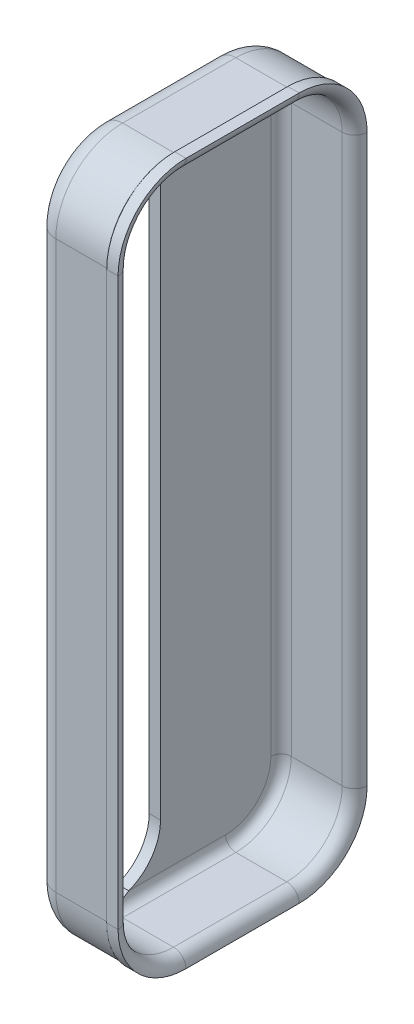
ISO-10303-21;
HEADER;
FILE_DESCRIPTION(('STEP AP214'),'2;1');
FILE_NAME('part.step','',(''),(''),'','','');
FILE_SCHEMA(('AUTOMOTIVE_DESIGN { 1 0 10303 214 1 1 1 1 }'));
ENDSEC;
DATA;
#1=APPLICATION_CONTEXT('core data for automotive mechanical design processes');
#2=APPLICATION_PROTOCOL_DEFINITION('international standard','automotive_design',2000,#1);
#3=PRODUCT_CONTEXT('',#1,'mechanical');
#4=PRODUCT('Part','Part','',(#3));
#5=PRODUCT_RELATED_PRODUCT_CATEGORY('part','',(#4));
#6=PRODUCT_DEFINITION_FORMATION('','',#4);
#7=PRODUCT_DEFINITION_CONTEXT('part definition',#1,'design');
#8=PRODUCT_DEFINITION('design','',#6,#7);
#9=PRODUCT_DEFINITION_SHAPE('','',#8);
#10=(LENGTH_UNIT() NAMED_UNIT(*) SI_UNIT(.MILLI.,.METRE.));
#11=(NAMED_UNIT(*) PLANE_ANGLE_UNIT() SI_UNIT($,.RADIAN.));
#12=(NAMED_UNIT(*) SI_UNIT($,.STERADIAN.) SOLID_ANGLE_UNIT());
#13=UNCERTAINTY_MEASURE_WITH_UNIT(LENGTH_MEASURE(1.E-05),#10,'distance_accuracy_value','');
#14=(GEOMETRIC_REPRESENTATION_CONTEXT(3) GLOBAL_UNCERTAINTY_ASSIGNED_CONTEXT((#13)) GLOBAL_UNIT_ASSIGNED_CONTEXT((#10,
#11,#12)) REPRESENTATION_CONTEXT('',''));
#15=CARTESIAN_POINT('',(0.,0.,0.));
#16=DIRECTION('',(0.,0.,1.));
#17=DIRECTION('',(1.,0.,0.));
#18=AXIS2_PLACEMENT_3D('',#15,#16,#17);
#19=CARTESIAN_POINT('',(38.3720577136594,47.5,4.94499999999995));
#20=DIRECTION('',(0.500000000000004,0.,0.866025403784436));
#21=DIRECTION('',(0.866025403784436,0.,-0.500000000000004));
#22=AXIS2_PLACEMENT_3D('',#19,#20,#21);
#23=PLANE('',#22);
#24=DIRECTION('',(0.,1.,0.));
#25=VECTOR('',#24,1.);
#26=CARTESIAN_POINT('',(38.285455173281,45.,4.99499999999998));
#27=LINE('',#26,#25);
#28=CARTESIAN_POINT('',(38.285455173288,50.,4.99500000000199));
#29=VERTEX_POINT('',#28);
#30=CARTESIAN_POINT('',(38.285455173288,45.,4.99499999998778));
#31=VERTEX_POINT('',#30);
#32=EDGE_CURVE('E245',#29,#31,#27,.F.);
#33=ORIENTED_EDGE('',*,*,#32,.F.);
#34=DIRECTION('',(0.866025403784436,0.,-0.500000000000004));
#35=VECTOR('',#34,1.);
#36=CARTESIAN_POINT('',(38.3720577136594,50.,4.94499999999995));
#37=LINE('',#36,#35);
#38=CARTESIAN_POINT('',(38.3720577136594,50.,4.94499999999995));
#39=VERTEX_POINT('',#38);
#40=EDGE_CURVE('E267',#39,#29,#37,.F.);
#41=ORIENTED_EDGE('',*,*,#40,.F.);
#42=DIRECTION('',(0.,1.,0.));
#43=VECTOR('',#42,1.);
#44=CARTESIAN_POINT('',(38.3720577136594,45.,4.94499999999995));
#45=LINE('',#44,#43);
#46=CARTESIAN_POINT('',(38.3720577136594,45.,4.94499999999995));
#47=VERTEX_POINT('',#46);
#48=EDGE_CURVE('E290',#39,#47,#45,.F.);
#49=ORIENTED_EDGE('',*,*,#48,.T.);
#50=DIRECTION('',(0.866025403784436,0.,-0.500000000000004));
#51=VECTOR('',#50,1.);
#52=CARTESIAN_POINT('',(38.3720577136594,45.,4.94499999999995));
#53=LINE('',#52,#51);
#54=EDGE_CURVE('E273',#31,#47,#53,.T.);
#55=ORIENTED_EDGE('',*,*,#54,.F.);
#56=EDGE_LOOP('',(#33,#41,#49,#55));
#57=FACE_BOUND('',#56,.T.);
#58=ADVANCED_FACE('F17',(#57),#23,.F.);
#59=CARTESIAN_POINT('',(38.45,45.,4.89999999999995));
#60=DIRECTION('',(0.,1.,0.));
#61=DIRECTION('',(0.,0.,1.));
#62=AXIS2_PLACEMENT_3D('',#59,#60,#61);
#63=CYLINDRICAL_SURFACE('',#62,0.0899999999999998);
#64=ORIENTED_EDGE('',*,*,#48,.F.);
#65=CARTESIAN_POINT('',(38.45,50.,4.89999999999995));
#66=DIRECTION('',(0.,1.,0.));
#67=DIRECTION('',(0.,0.,1.));
#68=AXIS2_PLACEMENT_3D('',#65,#66,#67);
#69=CIRCLE('',#68,0.0899999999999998);
#70=CARTESIAN_POINT('',(38.45,50.,4.98999999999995));
#71=VERTEX_POINT('',#70);
#72=EDGE_CURVE('E287',#71,#39,#69,.F.);
#73=ORIENTED_EDGE('',*,*,#72,.F.);
#74=DIRECTION('',(0.,-1.,0.));
#75=VECTOR('',#74,1.);
#76=CARTESIAN_POINT('',(38.45,50.,4.98999999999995));
#77=LINE('',#76,#75);
#78=CARTESIAN_POINT('',(38.45,45.,4.98999999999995));
#79=VERTEX_POINT('',#78);
#80=EDGE_CURVE('E279',#71,#79,#77,.T.);
#81=ORIENTED_EDGE('',*,*,#80,.T.);
#82=CARTESIAN_POINT('',(38.45,45.,4.89999999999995));
#83=DIRECTION('',(0.,1.,0.));
#84=DIRECTION('',(0.,0.,1.));
#85=AXIS2_PLACEMENT_3D('',#82,#83,#84);
#86=CIRCLE('',#85,0.0899999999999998);
#87=EDGE_CURVE('E292',#47,#79,#86,.T.);
#88=ORIENTED_EDGE('',*,*,#87,.F.);
#89=EDGE_LOOP('',(#64,#73,#81,#88));
#90=FACE_BOUND('',#89,.T.);
#91=ADVANCED_FACE('F948',(#90),#63,.F.);
#92=CARTESIAN_POINT('',(38.9,50.,5.09999999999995));
#93=DIRECTION('',(0.,1.,0.));
#94=DIRECTION('',(0.,0.,1.));
#95=AXIS2_PLACEMENT_3D('',#92,#93,#94);
#96=CYLINDRICAL_SURFACE('',#95,0.00999999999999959);
#97=DIRECTION('',(0.,1.,0.));
#98=VECTOR('',#97,1.);
#99=CARTESIAN_POINT('',(38.91,47.5,5.09999999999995));
#100=LINE('',#99,#98);
#101=CARTESIAN_POINT('',(38.91,45.,5.09999999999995));
#102=VERTEX_POINT('',#101);
#103=CARTESIAN_POINT('',(38.91,50.,5.09999999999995));
#104=VERTEX_POINT('',#103);
#105=EDGE_CURVE('E1487',#102,#104,#100,.T.);
#106=ORIENTED_EDGE('',*,*,#105,.T.);
#107=CARTESIAN_POINT('',(38.9,50.,5.09999999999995));
#108=DIRECTION('',(0.,-1.,0.));
#109=DIRECTION('',(0.,0.,1.));
#110=AXIS2_PLACEMENT_3D('',#107,#108,#109);
#111=CIRCLE('',#110,0.01);
#112=CARTESIAN_POINT('',(38.9,50.,5.08999999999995));
#113=VERTEX_POINT('',#112);
#114=EDGE_CURVE('E921',#104,#113,#111,.F.);
#115=ORIENTED_EDGE('',*,*,#114,.T.);
#116=DIRECTION('',(0.,-1.,0.));
#117=VECTOR('',#116,1.);
#118=CARTESIAN_POINT('',(38.9,50.,5.08999999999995));
#119=LINE('',#118,#117);
#120=CARTESIAN_POINT('',(38.9,45.,5.08999999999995));
#121=VERTEX_POINT('',#120);
#122=EDGE_CURVE('E919',#121,#113,#119,.F.);
#123=ORIENTED_EDGE('',*,*,#122,.F.);
#124=CARTESIAN_POINT('',(38.9,45.,5.09999999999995));
#125=DIRECTION('',(0.,1.,0.));
#126=DIRECTION('',(0.,0.,1.));
#127=AXIS2_PLACEMENT_3D('',#124,#125,#126);
#128=CIRCLE('',#127,0.00999999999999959);
#129=EDGE_CURVE('E1489',#102,#121,#128,.T.);
#130=ORIENTED_EDGE('',*,*,#129,.F.);
#131=EDGE_LOOP('',(#106,#115,#123,#130));
#132=FACE_BOUND('',#131,.T.);
#133=ADVANCED_FACE('F945',(#132),#96,.F.);
#134=CARTESIAN_POINT('',(38.45,45.,4.89999999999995));
#135=DIRECTION('',(0.,1.,0.));
#136=DIRECTION('',(0.,0.,1.));
#137=AXIS2_PLACEMENT_3D('',#134,#135,#136);
#138=CYLINDRICAL_SURFACE('',#137,0.19);
#139=CARTESIAN_POINT('',(38.45,50.,4.89999999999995));
#140=DIRECTION('',(0.,1.,0.));
#141=DIRECTION('',(0.,0.,1.));
#142=AXIS2_PLACEMENT_3D('',#139,#140,#141);
#143=CIRCLE('',#142,0.19);
#144=CARTESIAN_POINT('',(38.45,50.,5.08999999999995));
#145=VERTEX_POINT('',#144);
#146=EDGE_CURVE('E241',#145,#29,#143,.F.);
#147=ORIENTED_EDGE('',*,*,#146,.T.);
#148=ORIENTED_EDGE('',*,*,#32,.T.);
#149=CARTESIAN_POINT('',(38.45,45.,4.89999999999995));
#150=DIRECTION('',(0.,1.,0.));
#151=DIRECTION('',(0.,0.,1.));
#152=AXIS2_PLACEMENT_3D('',#149,#150,#151);
#153=CIRCLE('',#152,0.19);
#154=CARTESIAN_POINT('',(38.45,45.,5.08999999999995));
#155=VERTEX_POINT('',#154);
#156=EDGE_CURVE('E251',#31,#155,#153,.T.);
#157=ORIENTED_EDGE('',*,*,#156,.T.);
#158=DIRECTION('',(0.,-1.,0.));
#159=VECTOR('',#158,1.);
#160=CARTESIAN_POINT('',(38.45,50.,5.08999999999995));
#161=LINE('',#160,#159);
#162=EDGE_CURVE('E248',#145,#155,#161,.T.);
#163=ORIENTED_EDGE('',*,*,#162,.F.);
#164=EDGE_LOOP('',(#147,#148,#157,#163));
#165=FACE_BOUND('',#164,.T.);
#166=ADVANCED_FACE('F243',(#165),#138,.T.);
#167=CARTESIAN_POINT('',(38.35,50.,4.98999999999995));
#168=DIRECTION('',(0.,0.,1.));
#169=DIRECTION('',(0.,-1.,0.));
#170=AXIS2_PLACEMENT_3D('',#167,#168,#169);
#171=PLANE('',#170);
#172=ORIENTED_EDGE('',*,*,#80,.F.);
#173=DIRECTION('',(1.,0.,0.));
#174=VECTOR('',#173,1.);
#175=CARTESIAN_POINT('',(38.35,50.,4.98999999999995));
#176=LINE('',#175,#174);
#177=CARTESIAN_POINT('',(38.9,50.,4.98999999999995));
#178=VERTEX_POINT('',#177);
#179=EDGE_CURVE('E276',#178,#71,#176,.F.);
#180=ORIENTED_EDGE('',*,*,#179,.F.);
#181=DIRECTION('',(0.,1.,0.));
#182=VECTOR('',#181,1.);
#183=CARTESIAN_POINT('',(38.9,50.,4.98999999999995));
#184=LINE('',#183,#182);
#185=CARTESIAN_POINT('',(38.9,45.,4.98999999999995));
#186=VERTEX_POINT('',#185);
#187=EDGE_CURVE('E1457',#186,#178,#184,.T.);
#188=ORIENTED_EDGE('',*,*,#187,.F.);
#189=DIRECTION('',(1.,0.,0.));
#190=VECTOR('',#189,1.);
#191=CARTESIAN_POINT('',(38.35,45.,4.98999999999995));
#192=LINE('',#191,#190);
#193=EDGE_CURVE('E1451',#79,#186,#192,.T.);
#194=ORIENTED_EDGE('',*,*,#193,.F.);
#195=EDGE_LOOP('',(#172,#180,#188,#194));
#196=FACE_BOUND('',#195,.T.);
#197=ADVANCED_FACE('F938',(#196),#171,.F.);
#198=CARTESIAN_POINT('',(39.01,47.5,5.09999999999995));
#199=DIRECTION('',(0.,0.,-1.));
#200=DIRECTION('',(0.,1.,0.));
#201=AXIS2_PLACEMENT_3D('',#198,#199,#200);
#202=PLANE('',#201);
#203=ORIENTED_EDGE('',*,*,#105,.F.);
#204=DIRECTION('',(1.,0.,0.));
#205=VECTOR('',#204,1.);
#206=CARTESIAN_POINT('',(39.01,45.,5.09999999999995));
#207=LINE('',#206,#205);
#208=CARTESIAN_POINT('',(39.01,45.,5.09999999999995));
#209=VERTEX_POINT('',#208);
#210=EDGE_CURVE('E1454',#209,#102,#207,.F.);
#211=ORIENTED_EDGE('',*,*,#210,.F.);
#212=DIRECTION('',(0.,1.,0.));
#213=VECTOR('',#212,1.);
#214=CARTESIAN_POINT('',(39.01,50.,5.09999999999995));
#215=LINE('',#214,#213);
#216=CARTESIAN_POINT('',(39.01,50.,5.09999999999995));
#217=VERTEX_POINT('',#216);
#218=EDGE_CURVE('E1460',#217,#209,#215,.F.);
#219=ORIENTED_EDGE('',*,*,#218,.F.);
#220=DIRECTION('',(1.,0.,0.));
#221=VECTOR('',#220,1.);
#222=CARTESIAN_POINT('',(38.9,50.,5.09999999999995));
#223=LINE('',#222,#221);
#224=EDGE_CURVE('E1464',#104,#217,#223,.T.);
#225=ORIENTED_EDGE('',*,*,#224,.F.);
#226=EDGE_LOOP('',(#203,#211,#219,#225));
#227=FACE_BOUND('',#226,.T.);
#228=ADVANCED_FACE('F934',(#227),#202,.F.);
#229=CARTESIAN_POINT('',(38.9,50.,4.49999999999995));
#230=DIRECTION('',(1.,0.,0.));
#231=DIRECTION('',(0.,0.,-1.));
#232=AXIS2_PLACEMENT_3D('',#229,#230,#231);
#233=TOROIDAL_SURFACE('',#232,0.600000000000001,0.01);
#234=CARTESIAN_POINT('',(38.9,50.,4.49999999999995));
#235=DIRECTION('',(1.,0.,0.));
#236=DIRECTION('',(0.,0.,-1.));
#237=AXIS2_PLACEMENT_3D('',#234,#235,#236);
#238=CIRCLE('',#237,0.59);
#239=CARTESIAN_POINT('',(38.9,50.59,4.49999999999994));
#240=VERTEX_POINT('',#239);
#241=EDGE_CURVE('E1428',#113,#240,#238,.F.);
#242=ORIENTED_EDGE('',*,*,#241,.F.);
#243=ORIENTED_EDGE('',*,*,#114,.F.);
#244=CARTESIAN_POINT('',(38.91,50.,4.49999999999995));
#245=DIRECTION('',(1.,0.,0.));
#246=DIRECTION('',(0.,0.,-1.));
#247=AXIS2_PLACEMENT_3D('',#244,#245,#246);
#248=CIRCLE('',#247,0.600000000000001);
#249=CARTESIAN_POINT('',(38.91,50.6,4.49999999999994));
#250=VERTEX_POINT('',#249);
#251=EDGE_CURVE('E925',#250,#104,#248,.T.);
#252=ORIENTED_EDGE('',*,*,#251,.F.);
#253=CARTESIAN_POINT('',(38.9,50.6,4.49999999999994));
#254=DIRECTION('',(0.,0.,-1.));
#255=DIRECTION('',(-1.,0.,0.));
#256=AXIS2_PLACEMENT_3D('',#253,#254,#255);
#257=CIRCLE('',#256,0.0100000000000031);
#258=EDGE_CURVE('E1660',#250,#240,#257,.T.);
#259=ORIENTED_EDGE('',*,*,#258,.T.);
#260=EDGE_LOOP('',(#242,#243,#252,#259));
#261=FACE_BOUND('',#260,.T.);
#262=ADVANCED_FACE('F931',(#261),#233,.F.);
#263=CARTESIAN_POINT('',(38.35,50.,5.08999999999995));
#264=DIRECTION('',(0.,0.,1.));
#265=DIRECTION('',(0.,-1.,0.));
#266=AXIS2_PLACEMENT_3D('',#263,#264,#265);
#267=PLANE('',#266);
#268=DIRECTION('',(1.,0.,0.));
#269=VECTOR('',#268,1.);
#270=CARTESIAN_POINT('',(38.35,50.,5.08999999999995));
#271=LINE('',#270,#269);
#272=EDGE_CURVE('E1422',#145,#113,#271,.T.);
#273=ORIENTED_EDGE('',*,*,#272,.F.);
#274=ORIENTED_EDGE('',*,*,#162,.T.);
#275=DIRECTION('',(1.,0.,0.));
#276=VECTOR('',#275,1.);
#277=CARTESIAN_POINT('',(38.35,45.,5.08999999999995));
#278=LINE('',#277,#276);
#279=EDGE_CURVE('E1511',#121,#155,#278,.F.);
#280=ORIENTED_EDGE('',*,*,#279,.F.);
#281=ORIENTED_EDGE('',*,*,#122,.T.);
#282=EDGE_LOOP('',(#273,#274,#280,#281));
#283=FACE_BOUND('',#282,.T.);
#284=ADVANCED_FACE('F911',(#283),#267,.T.);
#285=CARTESIAN_POINT('',(38.9,45.,4.49999999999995));
#286=DIRECTION('',(1.,0.,0.));
#287=DIRECTION('',(0.,0.,-1.));
#288=AXIS2_PLACEMENT_3D('',#285,#286,#287);
#289=TOROIDAL_SURFACE('',#288,0.6,0.01);
#290=CARTESIAN_POINT('',(38.91,45.,4.49999999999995));
#291=DIRECTION('',(1.,0.,0.));
#292=DIRECTION('',(0.,0.,-1.));
#293=AXIS2_PLACEMENT_3D('',#290,#291,#292);
#294=CIRCLE('',#293,0.6);
#295=CARTESIAN_POINT('',(38.91,44.4,4.49999999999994));
#296=VERTEX_POINT('',#295);
#297=EDGE_CURVE('E1429',#102,#296,#294,.T.);
#298=ORIENTED_EDGE('',*,*,#297,.F.);
#299=ORIENTED_EDGE('',*,*,#129,.T.);
#300=CARTESIAN_POINT('',(38.9,45.,4.49999999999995));
#301=DIRECTION('',(1.,0.,0.));
#302=DIRECTION('',(0.,0.,-1.));
#303=AXIS2_PLACEMENT_3D('',#300,#301,#302);
#304=CIRCLE('',#303,0.59);
#305=CARTESIAN_POINT('',(38.9,44.41,4.49999999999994));
#306=VERTEX_POINT('',#305);
#307=EDGE_CURVE('E1508',#306,#121,#304,.F.);
#308=ORIENTED_EDGE('',*,*,#307,.F.);
#309=CARTESIAN_POINT('',(38.9,44.4,4.49999999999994));
#310=DIRECTION('',(0.,0.,1.));
#311=DIRECTION('',(1.,0.,0.));
#312=AXIS2_PLACEMENT_3D('',#309,#310,#311);
#313=CIRCLE('',#312,0.0100000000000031);
#314=EDGE_CURVE('E860',#306,#296,#313,.F.);
#315=ORIENTED_EDGE('',*,*,#314,.T.);
#316=EDGE_LOOP('',(#298,#299,#308,#315));
#317=FACE_BOUND('',#316,.T.);
#318=ADVANCED_FACE('F906',(#317),#289,.F.);
#319=CARTESIAN_POINT('',(38.9,50.,4.49999999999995));
#320=DIRECTION('',(1.,0.,0.));
#321=DIRECTION('',(0.,0.,-1.));
#322=AXIS2_PLACEMENT_3D('',#319,#320,#321);
#323=CYLINDRICAL_SURFACE('',#322,0.600000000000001);
#324=ORIENTED_EDGE('',*,*,#224,.T.);
#325=CARTESIAN_POINT('',(39.01,50.,4.49999999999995));
#326=DIRECTION('',(1.,0.,0.));
#327=DIRECTION('',(0.,0.,-1.));
#328=AXIS2_PLACEMENT_3D('',#325,#326,#327);
#329=CIRCLE('',#328,0.599999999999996);
#330=CARTESIAN_POINT('',(39.01,50.6,4.49999999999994));
#331=VERTEX_POINT('',#330);
#332=EDGE_CURVE('E1496',#331,#217,#329,.T.);
#333=ORIENTED_EDGE('',*,*,#332,.F.);
#334=DIRECTION('',(1.,0.,0.));
#335=VECTOR('',#334,1.);
#336=CARTESIAN_POINT('',(39.01,50.6,4.49999999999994));
#337=LINE('',#336,#335);
#338=EDGE_CURVE('E1483',#331,#250,#337,.F.);
#339=ORIENTED_EDGE('',*,*,#338,.T.);
#340=ORIENTED_EDGE('',*,*,#251,.T.);
#341=EDGE_LOOP('',(#324,#333,#339,#340));
#342=FACE_BOUND('',#341,.T.);
#343=ADVANCED_FACE('F902',(#342),#323,.T.);
#344=CARTESIAN_POINT('',(38.9,50.,5.09999999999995));
#345=DIRECTION('',(0.,1.,0.));
#346=DIRECTION('',(0.,0.,1.));
#347=AXIS2_PLACEMENT_3D('',#344,#345,#346);
#348=CYLINDRICAL_SURFACE('',#347,0.11);
#349=CARTESIAN_POINT('',(38.9,50.,5.09999999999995));
#350=DIRECTION('',(0.,-1.,0.));
#351=DIRECTION('',(0.,0.,1.));
#352=AXIS2_PLACEMENT_3D('',#349,#350,#351);
#353=CIRCLE('',#352,0.11);
#354=EDGE_CURVE('E823',#217,#178,#353,.F.);
#355=ORIENTED_EDGE('',*,*,#354,.F.);
#356=ORIENTED_EDGE('',*,*,#218,.T.);
#357=CARTESIAN_POINT('',(38.9,45.,5.09999999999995));
#358=DIRECTION('',(0.,1.,0.));
#359=DIRECTION('',(0.,0.,1.));
#360=AXIS2_PLACEMENT_3D('',#357,#358,#359);
#361=CIRCLE('',#360,0.11);
#362=EDGE_CURVE('E1450',#209,#186,#361,.T.);
#363=ORIENTED_EDGE('',*,*,#362,.T.);
#364=ORIENTED_EDGE('',*,*,#187,.T.);
#365=EDGE_LOOP('',(#355,#356,#363,#364));
#366=FACE_BOUND('',#365,.T.);
#367=ADVANCED_FACE('F898',(#366),#348,.T.);
#368=CARTESIAN_POINT('',(38.9,45.,4.49999999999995));
#369=DIRECTION('',(1.,0.,0.));
#370=DIRECTION('',(0.,0.,-1.));
#371=AXIS2_PLACEMENT_3D('',#368,#369,#370);
#372=CYLINDRICAL_SURFACE('',#371,0.6);
#373=CARTESIAN_POINT('',(39.01,45.,4.49999999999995));
#374=DIRECTION('',(1.,0.,0.));
#375=DIRECTION('',(0.,0.,-1.));
#376=AXIS2_PLACEMENT_3D('',#373,#374,#375);
#377=CIRCLE('',#376,0.6);
#378=CARTESIAN_POINT('',(39.01,44.4,4.49999999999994));
#379=VERTEX_POINT('',#378);
#380=EDGE_CURVE('E767',#209,#379,#377,.T.);
#381=ORIENTED_EDGE('',*,*,#380,.F.);
#382=ORIENTED_EDGE('',*,*,#210,.T.);
#383=ORIENTED_EDGE('',*,*,#297,.T.);
#384=DIRECTION('',(1.,0.,0.));
#385=VECTOR('',#384,1.);
#386=CARTESIAN_POINT('',(39.01,44.4,4.49999999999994));
#387=LINE('',#386,#385);
#388=EDGE_CURVE('E772',#296,#379,#387,.T.);
#389=ORIENTED_EDGE('',*,*,#388,.T.);
#390=EDGE_LOOP('',(#381,#382,#383,#389));
#391=FACE_BOUND('',#390,.T.);
#392=ADVANCED_FACE('F894',(#391),#372,.T.);
#393=CARTESIAN_POINT('',(38.35,50.,4.49999999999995));
#394=DIRECTION('',(1.,0.,0.));
#395=DIRECTION('',(0.,0.,-1.));
#396=AXIS2_PLACEMENT_3D('',#393,#394,#395);
#397=CYLINDRICAL_SURFACE('',#396,0.59);
#398=ORIENTED_EDGE('',*,*,#272,.T.);
#399=ORIENTED_EDGE('',*,*,#241,.T.);
#400=DIRECTION('',(1.,0.,0.));
#401=VECTOR('',#400,1.);
#402=CARTESIAN_POINT('',(38.35,50.59,4.49999999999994));
#403=LINE('',#402,#401);
#404=CARTESIAN_POINT('',(38.45,50.59,4.49999999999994));
#405=VERTEX_POINT('',#404);
#406=EDGE_CURVE('E766',#405,#240,#403,.T.);
#407=ORIENTED_EDGE('',*,*,#406,.F.);
#408=CARTESIAN_POINT('',(38.45,50.,4.49999999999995));
#409=DIRECTION('',(-1.,0.,0.));
#410=DIRECTION('',(0.,0.,1.));
#411=AXIS2_PLACEMENT_3D('',#408,#409,#410);
#412=CIRCLE('',#411,0.59);
#413=EDGE_CURVE('E764',#145,#405,#412,.T.);
#414=ORIENTED_EDGE('',*,*,#413,.F.);
#415=EDGE_LOOP('',(#398,#399,#407,#414));
#416=FACE_BOUND('',#415,.T.);
#417=ADVANCED_FACE('F890',(#416),#397,.T.);
#418=CARTESIAN_POINT('',(38.9,50.6,3.49999999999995));
#419=DIRECTION('',(0.,0.,-1.));
#420=DIRECTION('',(-1.,0.,0.));
#421=AXIS2_PLACEMENT_3D('',#418,#419,#420);
#422=CYLINDRICAL_SURFACE('',#421,0.0100000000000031);
#423=DIRECTION('',(0.,0.,1.));
#424=VECTOR('',#423,1.);
#425=CARTESIAN_POINT('',(38.9,50.59,3.49999999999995));
#426=LINE('',#425,#424);
#427=CARTESIAN_POINT('',(38.9,50.59,3.49999999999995));
#428=VERTEX_POINT('',#427);
#429=EDGE_CURVE('E1650',#240,#428,#426,.F.);
#430=ORIENTED_EDGE('',*,*,#429,.F.);
#431=ORIENTED_EDGE('',*,*,#258,.F.);
#432=DIRECTION('',(0.,0.,-1.));
#433=VECTOR('',#432,1.);
#434=CARTESIAN_POINT('',(38.91,50.6,3.99999999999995));
#435=LINE('',#434,#433);
#436=CARTESIAN_POINT('',(38.91,50.6,3.49999999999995));
#437=VERTEX_POINT('',#436);
#438=EDGE_CURVE('E1499',#250,#437,#435,.T.);
#439=ORIENTED_EDGE('',*,*,#438,.T.);
#440=CARTESIAN_POINT('',(38.9,50.6,3.49999999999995));
#441=DIRECTION('',(0.,0.,1.));
#442=DIRECTION('',(0.,1.,0.));
#443=AXIS2_PLACEMENT_3D('',#440,#441,#442);
#444=CIRCLE('',#443,0.01);
#445=EDGE_CURVE('E872',#437,#428,#444,.F.);
#446=ORIENTED_EDGE('',*,*,#445,.T.);
#447=EDGE_LOOP('',(#430,#431,#439,#446));
#448=FACE_BOUND('',#447,.T.);
#449=ADVANCED_FACE('F886',(#448),#422,.F.);
#450=CARTESIAN_POINT('',(38.9,50.,3.49999999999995));
#451=DIRECTION('',(1.,0.,0.));
#452=DIRECTION('',(0.,0.,-1.));
#453=AXIS2_PLACEMENT_3D('',#450,#451,#452);
#454=TOROIDAL_SURFACE('',#453,0.6,0.01);
#455=CARTESIAN_POINT('',(38.9,50.,3.49999999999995));
#456=DIRECTION('',(1.,0.,0.));
#457=DIRECTION('',(0.,0.,-1.));
#458=AXIS2_PLACEMENT_3D('',#455,#456,#457);
#459=CIRCLE('',#458,0.59);
#460=CARTESIAN_POINT('',(38.9,50.,2.90999999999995));
#461=VERTEX_POINT('',#460);
#462=EDGE_CURVE('E875',#428,#461,#459,.F.);
#463=ORIENTED_EDGE('',*,*,#462,.F.);
#464=ORIENTED_EDGE('',*,*,#445,.F.);
#465=CARTESIAN_POINT('',(38.91,50.,3.49999999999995));
#466=DIRECTION('',(1.,0.,0.));
#467=DIRECTION('',(0.,0.,-1.));
#468=AXIS2_PLACEMENT_3D('',#465,#466,#467);
#469=CIRCLE('',#468,0.6);
#470=CARTESIAN_POINT('',(38.91,50.,2.89999999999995));
#471=VERTEX_POINT('',#470);
#472=EDGE_CURVE('E818',#471,#437,#469,.T.);
#473=ORIENTED_EDGE('',*,*,#472,.F.);
#474=CARTESIAN_POINT('',(38.9,50.,2.89999999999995));
#475=DIRECTION('',(0.,-1.,0.));
#476=DIRECTION('',(0.,0.,-1.));
#477=AXIS2_PLACEMENT_3D('',#474,#475,#476);
#478=CIRCLE('',#477,0.01);
#479=EDGE_CURVE('E861',#471,#461,#478,.T.);
#480=ORIENTED_EDGE('',*,*,#479,.T.);
#481=EDGE_LOOP('',(#463,#464,#473,#480));
#482=FACE_BOUND('',#481,.T.);
#483=ADVANCED_FACE('F883',(#482),#454,.F.);
#484=CARTESIAN_POINT('',(38.9,50.,2.89999999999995));
#485=DIRECTION('',(0.,-1.,0.));
#486=DIRECTION('',(0.,0.,-1.));
#487=AXIS2_PLACEMENT_3D('',#484,#485,#486);
#488=CYLINDRICAL_SURFACE('',#487,0.01);
#489=DIRECTION('',(0.,1.,0.));
#490=VECTOR('',#489,1.);
#491=CARTESIAN_POINT('',(38.9,50.,2.90999999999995));
#492=LINE('',#491,#490);
#493=CARTESIAN_POINT('',(38.9,45.,2.90999999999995));
#494=VERTEX_POINT('',#493);
#495=EDGE_CURVE('E864',#461,#494,#492,.F.);
#496=ORIENTED_EDGE('',*,*,#495,.F.);
#497=ORIENTED_EDGE('',*,*,#479,.F.);
#498=DIRECTION('',(0.,-1.,0.));
#499=VECTOR('',#498,1.);
#500=CARTESIAN_POINT('',(38.91,47.5,2.89999999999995));
#501=LINE('',#500,#499);
#502=CARTESIAN_POINT('',(38.91,45.,2.89999999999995));
#503=VERTEX_POINT('',#502);
#504=EDGE_CURVE('E809',#471,#503,#501,.T.);
#505=ORIENTED_EDGE('',*,*,#504,.T.);
#506=CARTESIAN_POINT('',(38.9,45.,2.89999999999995));
#507=DIRECTION('',(0.,1.,0.));
#508=DIRECTION('',(0.,0.,-1.));
#509=AXIS2_PLACEMENT_3D('',#506,#507,#508);
#510=CIRCLE('',#509,0.01);
#511=EDGE_CURVE('E857',#503,#494,#510,.F.);
#512=ORIENTED_EDGE('',*,*,#511,.T.);
#513=EDGE_LOOP('',(#496,#497,#505,#512));
#514=FACE_BOUND('',#513,.T.);
#515=ADVANCED_FACE('F849',(#514),#488,.F.);
#516=CARTESIAN_POINT('',(38.9,45.,3.49999999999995));
#517=DIRECTION('',(1.,0.,0.));
#518=DIRECTION('',(0.,0.,-1.));
#519=AXIS2_PLACEMENT_3D('',#516,#517,#518);
#520=TOROIDAL_SURFACE('',#519,0.6,0.01);
#521=CARTESIAN_POINT('',(38.9,45.,3.49999999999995));
#522=DIRECTION('',(1.,0.,0.));
#523=DIRECTION('',(0.,0.,-1.));
#524=AXIS2_PLACEMENT_3D('',#521,#522,#523);
#525=CIRCLE('',#524,0.59);
#526=CARTESIAN_POINT('',(38.9,44.41,3.49999999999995));
#527=VERTEX_POINT('',#526);
#528=EDGE_CURVE('E1516',#494,#527,#525,.F.);
#529=ORIENTED_EDGE('',*,*,#528,.F.);
#530=ORIENTED_EDGE('',*,*,#511,.F.);
#531=CARTESIAN_POINT('',(38.91,45.,3.49999999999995));
#532=DIRECTION('',(1.,0.,0.));
#533=DIRECTION('',(0.,0.,-1.));
#534=AXIS2_PLACEMENT_3D('',#531,#532,#533);
#535=CIRCLE('',#534,0.6);
#536=CARTESIAN_POINT('',(38.91,44.4,3.49999999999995));
#537=VERTEX_POINT('',#536);
#538=EDGE_CURVE('E799',#537,#503,#535,.T.);
#539=ORIENTED_EDGE('',*,*,#538,.F.);
#540=CARTESIAN_POINT('',(38.9,44.4,3.49999999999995));
#541=DIRECTION('',(0.,0.,1.));
#542=DIRECTION('',(1.,0.,0.));
#543=AXIS2_PLACEMENT_3D('',#540,#541,#542);
#544=CIRCLE('',#543,0.0100000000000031);
#545=EDGE_CURVE('E1513',#537,#527,#544,.T.);
#546=ORIENTED_EDGE('',*,*,#545,.T.);
#547=EDGE_LOOP('',(#529,#530,#539,#546));
#548=FACE_BOUND('',#547,.T.);
#549=ADVANCED_FACE('F844',(#548),#520,.F.);
#550=CARTESIAN_POINT('',(38.9,44.4,3.49999999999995));
#551=DIRECTION('',(0.,0.,1.));
#552=DIRECTION('',(1.,0.,0.));
#553=AXIS2_PLACEMENT_3D('',#550,#551,#552);
#554=CYLINDRICAL_SURFACE('',#553,0.0100000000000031);
#555=DIRECTION('',(0.,0.,1.));
#556=VECTOR('',#555,1.);
#557=CARTESIAN_POINT('',(38.91,44.4,3.99999999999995));
#558=LINE('',#557,#556);
#559=EDGE_CURVE('E776',#537,#296,#558,.T.);
#560=ORIENTED_EDGE('',*,*,#559,.T.);
#561=ORIENTED_EDGE('',*,*,#314,.F.);
#562=DIRECTION('',(0.,0.,-1.));
#563=VECTOR('',#562,1.);
#564=CARTESIAN_POINT('',(38.9,44.41,3.49999999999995));
#565=LINE('',#564,#563);
#566=EDGE_CURVE('E1525',#527,#306,#565,.F.);
#567=ORIENTED_EDGE('',*,*,#566,.F.);
#568=ORIENTED_EDGE('',*,*,#545,.F.);
#569=EDGE_LOOP('',(#560,#561,#567,#568));
#570=FACE_BOUND('',#569,.T.);
#571=ADVANCED_FACE('F840',(#570),#554,.F.);
#572=CARTESIAN_POINT('',(38.35,45.,4.49999999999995));
#573=DIRECTION('',(1.,0.,0.));
#574=DIRECTION('',(0.,0.,-1.));
#575=AXIS2_PLACEMENT_3D('',#572,#573,#574);
#576=CYLINDRICAL_SURFACE('',#575,0.59);
#577=DIRECTION('',(1.,0.,0.));
#578=VECTOR('',#577,1.);
#579=CARTESIAN_POINT('',(38.35,44.41,4.49999999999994));
#580=LINE('',#579,#578);
#581=CARTESIAN_POINT('',(38.45,44.41,4.49999999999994));
#582=VERTEX_POINT('',#581);
#583=EDGE_CURVE('E1518',#306,#582,#580,.F.);
#584=ORIENTED_EDGE('',*,*,#583,.F.);
#585=ORIENTED_EDGE('',*,*,#307,.T.);
#586=ORIENTED_EDGE('',*,*,#279,.T.);
#587=CARTESIAN_POINT('',(38.45,45.,4.49999999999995));
#588=DIRECTION('',(-1.,0.,0.));
#589=DIRECTION('',(0.,0.,1.));
#590=AXIS2_PLACEMENT_3D('',#587,#588,#589);
#591=CIRCLE('',#590,0.59);
#592=EDGE_CURVE('E724',#582,#155,#591,.T.);
#593=ORIENTED_EDGE('',*,*,#592,.F.);
#594=EDGE_LOOP('',(#584,#585,#586,#593));
#595=FACE_BOUND('',#594,.T.);
#596=ADVANCED_FACE('F836',(#595),#576,.T.);
#597=CARTESIAN_POINT('',(39.01,50.6,3.99999999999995));
#598=DIRECTION('',(0.,-1.,0.));
#599=DIRECTION('',(0.,0.,-1.));
#600=AXIS2_PLACEMENT_3D('',#597,#598,#599);
#601=PLANE('',#600);
#602=ORIENTED_EDGE('',*,*,#438,.F.);
#603=ORIENTED_EDGE('',*,*,#338,.F.);
#604=DIRECTION('',(0.,0.,-1.));
#605=VECTOR('',#604,1.);
#606=CARTESIAN_POINT('',(39.01,50.6,3.49999999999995));
#607=LINE('',#606,#605);
#608=CARTESIAN_POINT('',(39.01,50.6,3.49999999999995));
#609=VERTEX_POINT('',#608);
#610=EDGE_CURVE('E715',#609,#331,#607,.F.);
#611=ORIENTED_EDGE('',*,*,#610,.F.);
#612=DIRECTION('',(1.,0.,0.));
#613=VECTOR('',#612,1.);
#614=CARTESIAN_POINT('',(38.9,50.6,3.49999999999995));
#615=LINE('',#614,#613);
#616=EDGE_CURVE('E810',#437,#609,#615,.T.);
#617=ORIENTED_EDGE('',*,*,#616,.F.);
#618=EDGE_LOOP('',(#602,#603,#611,#617));
#619=FACE_BOUND('',#618,.T.);
#620=ADVANCED_FACE('F831',(#619),#601,.F.);
#621=CARTESIAN_POINT('',(38.9,50.,4.49999999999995));
#622=DIRECTION('',(1.,0.,0.));
#623=DIRECTION('',(0.,0.,-1.));
#624=AXIS2_PLACEMENT_3D('',#621,#622,#623);
#625=TOROIDAL_SURFACE('',#624,0.600000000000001,0.11);
#626=ORIENTED_EDGE('',*,*,#354,.T.);
#627=CARTESIAN_POINT('',(38.9,50.,4.49999999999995));
#628=DIRECTION('',(1.,0.,0.));
#629=DIRECTION('',(0.,0.,-1.));
#630=AXIS2_PLACEMENT_3D('',#627,#628,#629);
#631=CIRCLE('',#630,0.490000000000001);
#632=CARTESIAN_POINT('',(38.9,50.49,4.49999999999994));
#633=VERTEX_POINT('',#632);
#634=EDGE_CURVE('E263',#178,#633,#631,.F.);
#635=ORIENTED_EDGE('',*,*,#634,.T.);
#636=CARTESIAN_POINT('',(38.9,50.6,4.49999999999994));
#637=DIRECTION('',(0.,0.,-1.));
#638=DIRECTION('',(-1.,0.,0.));
#639=AXIS2_PLACEMENT_3D('',#636,#637,#638);
#640=CIRCLE('',#639,0.109999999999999);
#641=EDGE_CURVE('E713',#331,#633,#640,.T.);
#642=ORIENTED_EDGE('',*,*,#641,.F.);
#643=ORIENTED_EDGE('',*,*,#332,.T.);
#644=EDGE_LOOP('',(#626,#635,#642,#643));
#645=FACE_BOUND('',#644,.T.);
#646=ADVANCED_FACE('F826',(#645),#625,.T.);
#647=CARTESIAN_POINT('',(38.9,50.,3.49999999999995));
#648=DIRECTION('',(1.,0.,0.));
#649=DIRECTION('',(0.,0.,-1.));
#650=AXIS2_PLACEMENT_3D('',#647,#648,#649);
#651=CYLINDRICAL_SURFACE('',#650,0.6);
#652=ORIENTED_EDGE('',*,*,#616,.T.);
#653=CARTESIAN_POINT('',(39.01,50.,3.49999999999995));
#654=DIRECTION('',(1.,0.,0.));
#655=DIRECTION('',(0.,0.,-1.));
#656=AXIS2_PLACEMENT_3D('',#653,#654,#655);
#657=CIRCLE('',#656,0.599999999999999);
#658=CARTESIAN_POINT('',(39.01,50.,2.89999999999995));
#659=VERTEX_POINT('',#658);
#660=EDGE_CURVE('E262',#659,#609,#657,.T.);
#661=ORIENTED_EDGE('',*,*,#660,.F.);
#662=DIRECTION('',(1.,0.,0.));
#663=VECTOR('',#662,1.);
#664=CARTESIAN_POINT('',(39.01,50.,2.89999999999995));
#665=LINE('',#664,#663);
#666=EDGE_CURVE('E806',#659,#471,#665,.F.);
#667=ORIENTED_EDGE('',*,*,#666,.T.);
#668=ORIENTED_EDGE('',*,*,#472,.T.);
#669=EDGE_LOOP('',(#652,#661,#667,#668));
#670=FACE_BOUND('',#669,.T.);
#671=ADVANCED_FACE('F830',(#670),#651,.T.);
#672=CARTESIAN_POINT('',(39.01,47.5,2.89999999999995));
#673=DIRECTION('',(0.,0.,1.));
#674=DIRECTION('',(0.,-1.,0.));
#675=AXIS2_PLACEMENT_3D('',#672,#673,#674);
#676=PLANE('',#675);
#677=ORIENTED_EDGE('',*,*,#504,.F.);
#678=ORIENTED_EDGE('',*,*,#666,.F.);
#679=DIRECTION('',(0.,-1.,0.));
#680=VECTOR('',#679,1.);
#681=CARTESIAN_POINT('',(39.01,50.,2.89999999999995));
#682=LINE('',#681,#680);
#683=CARTESIAN_POINT('',(39.01,45.,2.89999999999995));
#684=VERTEX_POINT('',#683);
#685=EDGE_CURVE('E702',#684,#659,#682,.F.);
#686=ORIENTED_EDGE('',*,*,#685,.F.);
#687=DIRECTION('',(1.,0.,0.));
#688=VECTOR('',#687,1.);
#689=CARTESIAN_POINT('',(38.9,45.,2.89999999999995));
#690=LINE('',#689,#688);
#691=EDGE_CURVE('E791',#503,#684,#690,.T.);
#692=ORIENTED_EDGE('',*,*,#691,.F.);
#693=EDGE_LOOP('',(#677,#678,#686,#692));
#694=FACE_BOUND('',#693,.T.);
#695=ADVANCED_FACE('F1248',(#694),#676,.F.);
#696=CARTESIAN_POINT('',(38.9,45.,3.49999999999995));
#697=DIRECTION('',(1.,0.,0.));
#698=DIRECTION('',(0.,0.,-1.));
#699=AXIS2_PLACEMENT_3D('',#696,#697,#698);
#700=CYLINDRICAL_SURFACE('',#699,0.6);
#701=ORIENTED_EDGE('',*,*,#691,.T.);
#702=CARTESIAN_POINT('',(39.01,45.,3.49999999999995));
#703=DIRECTION('',(1.,0.,0.));
#704=DIRECTION('',(0.,0.,-1.));
#705=AXIS2_PLACEMENT_3D('',#702,#703,#704);
#706=CIRCLE('',#705,0.599999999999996);
#707=CARTESIAN_POINT('',(39.01,44.4,3.49999999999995));
#708=VERTEX_POINT('',#707);
#709=EDGE_CURVE('E782',#708,#684,#706,.T.);
#710=ORIENTED_EDGE('',*,*,#709,.F.);
#711=DIRECTION('',(1.,0.,0.));
#712=VECTOR('',#711,1.);
#713=CARTESIAN_POINT('',(39.01,44.4,3.49999999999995));
#714=LINE('',#713,#712);
#715=EDGE_CURVE('E788',#708,#537,#714,.F.);
#716=ORIENTED_EDGE('',*,*,#715,.T.);
#717=ORIENTED_EDGE('',*,*,#538,.T.);
#718=EDGE_LOOP('',(#701,#710,#716,#717));
#719=FACE_BOUND('',#718,.T.);
#720=ADVANCED_FACE('F1240',(#719),#700,.T.);
#721=CARTESIAN_POINT('',(39.01,44.4,3.99999999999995));
#722=DIRECTION('',(0.,1.,0.));
#723=DIRECTION('',(0.,0.,1.));
#724=AXIS2_PLACEMENT_3D('',#721,#722,#723);
#725=PLANE('',#724);
#726=ORIENTED_EDGE('',*,*,#559,.F.);
#727=ORIENTED_EDGE('',*,*,#715,.F.);
#728=DIRECTION('',(0.,0.,1.));
#729=VECTOR('',#728,1.);
#730=CARTESIAN_POINT('',(39.01,44.4,3.49999999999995));
#731=LINE('',#730,#729);
#732=EDGE_CURVE('E665',#379,#708,#731,.F.);
#733=ORIENTED_EDGE('',*,*,#732,.F.);
#734=ORIENTED_EDGE('',*,*,#388,.F.);
#735=EDGE_LOOP('',(#726,#727,#733,#734));
#736=FACE_BOUND('',#735,.T.);
#737=ADVANCED_FACE('F1232',(#736),#725,.F.);
#738=CARTESIAN_POINT('',(38.9,45.,4.49999999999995));
#739=DIRECTION('',(1.,0.,0.));
#740=DIRECTION('',(0.,0.,-1.));
#741=AXIS2_PLACEMENT_3D('',#738,#739,#740);
#742=TOROIDAL_SURFACE('',#741,0.6,0.11);
#743=ORIENTED_EDGE('',*,*,#362,.F.);
#744=ORIENTED_EDGE('',*,*,#380,.T.);
#745=CARTESIAN_POINT('',(38.9,44.4,4.49999999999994));
#746=DIRECTION('',(0.,0.,1.));
#747=DIRECTION('',(1.,0.,0.));
#748=AXIS2_PLACEMENT_3D('',#745,#746,#747);
#749=CIRCLE('',#748,0.109999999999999);
#750=CARTESIAN_POINT('',(38.9,44.51,4.49999999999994));
#751=VERTEX_POINT('',#750);
#752=EDGE_CURVE('E652',#751,#379,#749,.F.);
#753=ORIENTED_EDGE('',*,*,#752,.F.);
#754=CARTESIAN_POINT('',(38.9,45.,4.49999999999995));
#755=DIRECTION('',(1.,0.,0.));
#756=DIRECTION('',(0.,0.,-1.));
#757=AXIS2_PLACEMENT_3D('',#754,#755,#756);
#758=CIRCLE('',#757,0.49);
#759=EDGE_CURVE('E642',#751,#186,#758,.F.);
#760=ORIENTED_EDGE('',*,*,#759,.T.);
#761=EDGE_LOOP('',(#743,#744,#753,#760));
#762=FACE_BOUND('',#761,.T.);
#763=ADVANCED_FACE('F756',(#762),#742,.T.);
#764=CARTESIAN_POINT('',(38.45,50.,4.49999999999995));
#765=DIRECTION('',(-1.,0.,0.));
#766=DIRECTION('',(0.,0.,1.));
#767=AXIS2_PLACEMENT_3D('',#764,#765,#766);
#768=TOROIDAL_SURFACE('',#767,0.4,0.19);
#769=CARTESIAN_POINT('',(38.45,50.4,4.49999999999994));
#770=DIRECTION('',(0.,0.,-1.));
#771=DIRECTION('',(-1.,0.,0.));
#772=AXIS2_PLACEMENT_3D('',#769,#770,#771);
#773=CIRCLE('',#772,0.190000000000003);
#774=CARTESIAN_POINT('',(38.2854551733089,50.4950000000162,4.49999999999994));
#775=VERTEX_POINT('',#774);
#776=EDGE_CURVE('E259',#775,#405,#773,.T.);
#777=ORIENTED_EDGE('',*,*,#776,.F.);
#778=CARTESIAN_POINT('',(38.2854551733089,50.,4.49999999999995));
#779=DIRECTION('',(-1.,0.,0.));
#780=DIRECTION('',(0.,0.,1.));
#781=AXIS2_PLACEMENT_3D('',#778,#779,#780);
#782=CIRCLE('',#781,0.495000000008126);
#783=EDGE_CURVE('E255',#775,#29,#782,.F.);
#784=ORIENTED_EDGE('',*,*,#783,.T.);
#785=ORIENTED_EDGE('',*,*,#146,.F.);
#786=ORIENTED_EDGE('',*,*,#413,.T.);
#787=EDGE_LOOP('',(#777,#784,#785,#786));
#788=FACE_BOUND('',#787,.T.);
#789=ADVANCED_FACE('F257',(#788),#768,.T.);
#790=CARTESIAN_POINT('',(38.35,50.59,3.49999999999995));
#791=DIRECTION('',(0.,1.,0.));
#792=DIRECTION('',(0.,0.,1.));
#793=AXIS2_PLACEMENT_3D('',#790,#791,#792);
#794=PLANE('',#793);
#795=ORIENTED_EDGE('',*,*,#406,.T.);
#796=ORIENTED_EDGE('',*,*,#429,.T.);
#797=DIRECTION('',(1.,0.,0.));
#798=VECTOR('',#797,1.);
#799=CARTESIAN_POINT('',(38.35,50.59,3.49999999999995));
#800=LINE('',#799,#798);
#801=CARTESIAN_POINT('',(38.45,50.59,3.49999999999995));
#802=VERTEX_POINT('',#801);
#803=EDGE_CURVE('E877',#802,#428,#800,.T.);
#804=ORIENTED_EDGE('',*,*,#803,.F.);
#805=DIRECTION('',(0.,0.,-1.));
#806=VECTOR('',#805,1.);
#807=CARTESIAN_POINT('',(38.45,50.59,4.49999999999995));
#808=LINE('',#807,#806);
#809=EDGE_CURVE('E1434',#405,#802,#808,.T.);
#810=ORIENTED_EDGE('',*,*,#809,.F.);
#811=EDGE_LOOP('',(#795,#796,#804,#810));
#812=FACE_BOUND('',#811,.T.);
#813=ADVANCED_FACE('F748',(#812),#794,.T.);
#814=CARTESIAN_POINT('',(38.35,50.,3.49999999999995));
#815=DIRECTION('',(1.,0.,0.));
#816=DIRECTION('',(0.,0.,-1.));
#817=AXIS2_PLACEMENT_3D('',#814,#815,#816);
#818=CYLINDRICAL_SURFACE('',#817,0.59);
#819=ORIENTED_EDGE('',*,*,#803,.T.);
#820=ORIENTED_EDGE('',*,*,#462,.T.);
#821=DIRECTION('',(1.,0.,0.));
#822=VECTOR('',#821,1.);
#823=CARTESIAN_POINT('',(38.35,50.,2.90999999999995));
#824=LINE('',#823,#822);
#825=CARTESIAN_POINT('',(38.45,50.,2.90999999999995));
#826=VERTEX_POINT('',#825);
#827=EDGE_CURVE('E867',#826,#461,#824,.T.);
#828=ORIENTED_EDGE('',*,*,#827,.F.);
#829=CARTESIAN_POINT('',(38.45,50.,3.49999999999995));
#830=DIRECTION('',(-1.,0.,0.));
#831=DIRECTION('',(0.,0.,1.));
#832=AXIS2_PLACEMENT_3D('',#829,#830,#831);
#833=CIRCLE('',#832,0.59);
#834=EDGE_CURVE('E1624',#802,#826,#833,.T.);
#835=ORIENTED_EDGE('',*,*,#834,.F.);
#836=EDGE_LOOP('',(#819,#820,#828,#835));
#837=FACE_BOUND('',#836,.T.);
#838=ADVANCED_FACE('F744',(#837),#818,.T.);
#839=CARTESIAN_POINT('',(38.35,50.,2.90999999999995));
#840=DIRECTION('',(0.,0.,-1.));
#841=DIRECTION('',(0.,1.,0.));
#842=AXIS2_PLACEMENT_3D('',#839,#840,#841);
#843=PLANE('',#842);
#844=ORIENTED_EDGE('',*,*,#827,.T.);
#845=ORIENTED_EDGE('',*,*,#495,.T.);
#846=DIRECTION('',(1.,0.,0.));
#847=VECTOR('',#846,1.);
#848=CARTESIAN_POINT('',(38.35,45.,2.90999999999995));
#849=LINE('',#848,#847);
#850=CARTESIAN_POINT('',(38.45,45.,2.90999999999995));
#851=VERTEX_POINT('',#850);
#852=EDGE_CURVE('E866',#851,#494,#849,.T.);
#853=ORIENTED_EDGE('',*,*,#852,.F.);
#854=DIRECTION('',(0.,-1.,0.));
#855=VECTOR('',#854,1.);
#856=CARTESIAN_POINT('',(38.45,45.,2.90999999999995));
#857=LINE('',#856,#855);
#858=EDGE_CURVE('E1618',#826,#851,#857,.T.);
#859=ORIENTED_EDGE('',*,*,#858,.F.);
#860=EDGE_LOOP('',(#844,#845,#853,#859));
#861=FACE_BOUND('',#860,.T.);
#862=ADVANCED_FACE('F740',(#861),#843,.T.);
#863=CARTESIAN_POINT('',(38.35,45.,3.49999999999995));
#864=DIRECTION('',(1.,0.,0.));
#865=DIRECTION('',(0.,0.,-1.));
#866=AXIS2_PLACEMENT_3D('',#863,#864,#865);
#867=CYLINDRICAL_SURFACE('',#866,0.59);
#868=ORIENTED_EDGE('',*,*,#852,.T.);
#869=ORIENTED_EDGE('',*,*,#528,.T.);
#870=DIRECTION('',(1.,0.,0.));
#871=VECTOR('',#870,1.);
#872=CARTESIAN_POINT('',(38.35,44.41,3.49999999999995));
#873=LINE('',#872,#871);
#874=CARTESIAN_POINT('',(38.45,44.41,3.49999999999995));
#875=VERTEX_POINT('',#874);
#876=EDGE_CURVE('E1528',#875,#527,#873,.T.);
#877=ORIENTED_EDGE('',*,*,#876,.F.);
#878=CARTESIAN_POINT('',(38.45,45.,3.49999999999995));
#879=DIRECTION('',(-1.,0.,0.));
#880=DIRECTION('',(0.,0.,1.));
#881=AXIS2_PLACEMENT_3D('',#878,#879,#880);
#882=CIRCLE('',#881,0.59);
#883=EDGE_CURVE('E1602',#851,#875,#882,.T.);
#884=ORIENTED_EDGE('',*,*,#883,.F.);
#885=EDGE_LOOP('',(#868,#869,#877,#884));
#886=FACE_BOUND('',#885,.T.);
#887=ADVANCED_FACE('F736',(#886),#867,.T.);
#888=CARTESIAN_POINT('',(38.35,44.41,3.49999999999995));
#889=DIRECTION('',(0.,-1.,0.));
#890=DIRECTION('',(0.,0.,-1.));
#891=AXIS2_PLACEMENT_3D('',#888,#889,#890);
#892=PLANE('',#891);
#893=ORIENTED_EDGE('',*,*,#876,.T.);
#894=ORIENTED_EDGE('',*,*,#566,.T.);
#895=ORIENTED_EDGE('',*,*,#583,.T.);
#896=DIRECTION('',(0.,0.,1.));
#897=VECTOR('',#896,1.);
#898=CARTESIAN_POINT('',(38.45,44.41,4.49999999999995));
#899=LINE('',#898,#897);
#900=EDGE_CURVE('E1596',#875,#582,#899,.T.);
#901=ORIENTED_EDGE('',*,*,#900,.F.);
#902=EDGE_LOOP('',(#893,#894,#895,#901));
#903=FACE_BOUND('',#902,.T.);
#904=ADVANCED_FACE('F732',(#903),#892,.T.);
#905=CARTESIAN_POINT('',(38.45,45.,4.49999999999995));
#906=DIRECTION('',(-1.,0.,0.));
#907=DIRECTION('',(0.,0.,1.));
#908=AXIS2_PLACEMENT_3D('',#905,#906,#907);
#909=TOROIDAL_SURFACE('',#908,0.4,0.19);
#910=ORIENTED_EDGE('',*,*,#156,.F.);
#911=CARTESIAN_POINT('',(38.2854551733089,45.,4.49999999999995));
#912=DIRECTION('',(-1.,0.,0.));
#913=DIRECTION('',(0.,0.,1.));
#914=AXIS2_PLACEMENT_3D('',#911,#912,#913);
#915=CIRCLE('',#914,0.494999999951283);
#916=CARTESIAN_POINT('',(38.2854551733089,44.5049999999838,4.49999999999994));
#917=VERTEX_POINT('',#916);
#918=EDGE_CURVE('E1436',#31,#917,#915,.F.);
#919=ORIENTED_EDGE('',*,*,#918,.T.);
#920=CARTESIAN_POINT('',(38.45,44.6,4.49999999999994));
#921=DIRECTION('',(0.,0.,1.));
#922=DIRECTION('',(1.,0.,0.));
#923=AXIS2_PLACEMENT_3D('',#920,#921,#922);
#924=CIRCLE('',#923,0.190000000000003);
#925=EDGE_CURVE('E1592',#582,#917,#924,.F.);
#926=ORIENTED_EDGE('',*,*,#925,.F.);
#927=ORIENTED_EDGE('',*,*,#592,.T.);
#928=EDGE_LOOP('',(#910,#919,#926,#927));
#929=FACE_BOUND('',#928,.T.);
#930=ADVANCED_FACE('F727',(#929),#909,.T.);
#931=CARTESIAN_POINT('',(38.9,50.6,3.49999999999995));
#932=DIRECTION('',(0.,0.,-1.));
#933=DIRECTION('',(-1.,0.,0.));
#934=AXIS2_PLACEMENT_3D('',#931,#932,#933);
#935=CYLINDRICAL_SURFACE('',#934,0.109999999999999);
#936=ORIENTED_EDGE('',*,*,#641,.T.);
#937=DIRECTION('',(0.,0.,1.));
#938=VECTOR('',#937,1.);
#939=CARTESIAN_POINT('',(38.9,50.49,3.49999999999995));
#940=LINE('',#939,#938);
#941=CARTESIAN_POINT('',(38.9,50.49,3.49999999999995));
#942=VERTEX_POINT('',#941);
#943=EDGE_CURVE('E705',#633,#942,#940,.F.);
#944=ORIENTED_EDGE('',*,*,#943,.T.);
#945=CARTESIAN_POINT('',(38.9,50.6,3.49999999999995));
#946=DIRECTION('',(0.,0.,1.));
#947=DIRECTION('',(0.,1.,0.));
#948=AXIS2_PLACEMENT_3D('',#945,#946,#947);
#949=CIRCLE('',#948,0.11);
#950=EDGE_CURVE('E700',#609,#942,#949,.F.);
#951=ORIENTED_EDGE('',*,*,#950,.F.);
#952=ORIENTED_EDGE('',*,*,#610,.T.);
#953=EDGE_LOOP('',(#936,#944,#951,#952));
#954=FACE_BOUND('',#953,.T.);
#955=ADVANCED_FACE('F731',(#954),#935,.T.);
#956=CARTESIAN_POINT('',(38.35,50.,4.49999999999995));
#957=DIRECTION('',(1.,0.,0.));
#958=DIRECTION('',(0.,0.,-1.));
#959=AXIS2_PLACEMENT_3D('',#956,#957,#958);
#960=CYLINDRICAL_SURFACE('',#959,0.490000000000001);
#961=ORIENTED_EDGE('',*,*,#634,.F.);
#962=ORIENTED_EDGE('',*,*,#179,.T.);
#963=CARTESIAN_POINT('',(38.45,50.,4.49999999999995));
#964=DIRECTION('',(-1.,0.,0.));
#965=DIRECTION('',(0.,0.,1.));
#966=AXIS2_PLACEMENT_3D('',#963,#964,#965);
#967=CIRCLE('',#966,0.49);
#968=CARTESIAN_POINT('',(38.45,50.49,4.49999999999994));
#969=VERTEX_POINT('',#968);
#970=EDGE_CURVE('E1585',#71,#969,#967,.T.);
#971=ORIENTED_EDGE('',*,*,#970,.T.);
#972=DIRECTION('',(1.,0.,0.));
#973=VECTOR('',#972,1.);
#974=CARTESIAN_POINT('',(38.35,50.49,4.49999999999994));
#975=LINE('',#974,#973);
#976=EDGE_CURVE('E708',#969,#633,#975,.T.);
#977=ORIENTED_EDGE('',*,*,#976,.T.);
#978=EDGE_LOOP('',(#961,#962,#971,#977));
#979=FACE_BOUND('',#978,.T.);
#980=ADVANCED_FACE('F1176',(#979),#960,.F.);
#981=CARTESIAN_POINT('',(38.2854551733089,50.,4.49999999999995));
#982=DIRECTION('',(-1.,0.,0.));
#983=DIRECTION('',(0.,0.,1.));
#984=AXIS2_PLACEMENT_3D('',#981,#982,#983);
#985=CONICAL_SURFACE('',#984,0.495000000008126,0.523598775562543);
#986=DIRECTION('',(0.866025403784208,-0.5000000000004,0.));
#987=VECTOR('',#986,1.);
#988=CARTESIAN_POINT('',(38.3287564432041,50.4700000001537,4.49999999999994));
#989=LINE('',#988,#987);
#990=CARTESIAN_POINT('',(38.3720577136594,50.445,4.49999999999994));
#991=VERTEX_POINT('',#990);
#992=EDGE_CURVE('E1584',#775,#991,#989,.T.);
#993=ORIENTED_EDGE('',*,*,#992,.T.);
#994=CARTESIAN_POINT('',(38.3720577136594,50.,4.49999999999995));
#995=DIRECTION('',(-1.,0.,0.));
#996=DIRECTION('',(0.,0.,1.));
#997=AXIS2_PLACEMENT_3D('',#994,#995,#996);
#998=CIRCLE('',#997,0.444999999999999);
#999=EDGE_CURVE('E269',#991,#39,#998,.F.);
#1000=ORIENTED_EDGE('',*,*,#999,.T.);
#1001=ORIENTED_EDGE('',*,*,#40,.T.);
#1002=ORIENTED_EDGE('',*,*,#783,.F.);
#1003=EDGE_LOOP('',(#993,#1000,#1001,#1002));
#1004=FACE_BOUND('',#1003,.T.);
#1005=ADVANCED_FACE('F268',(#1004),#985,.F.);
#1006=CARTESIAN_POINT('',(38.9,50.,3.49999999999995));
#1007=DIRECTION('',(1.,0.,0.));
#1008=DIRECTION('',(0.,0.,-1.));
#1009=AXIS2_PLACEMENT_3D('',#1006,#1007,#1008);
#1010=TOROIDAL_SURFACE('',#1009,0.6,0.11);
#1011=ORIENTED_EDGE('',*,*,#950,.T.);
#1012=CARTESIAN_POINT('',(38.9,50.,3.49999999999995));
#1013=DIRECTION('',(1.,0.,0.));
#1014=DIRECTION('',(0.,0.,-1.));
#1015=AXIS2_PLACEMENT_3D('',#1012,#1013,#1014);
#1016=CIRCLE('',#1015,0.49);
#1017=CARTESIAN_POINT('',(38.9,50.,3.00999999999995));
#1018=VERTEX_POINT('',#1017);
#1019=EDGE_CURVE('E496',#942,#1018,#1016,.F.);
#1020=ORIENTED_EDGE('',*,*,#1019,.T.);
#1021=CARTESIAN_POINT('',(38.9,50.,2.89999999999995));
#1022=DIRECTION('',(0.,-1.,0.));
#1023=DIRECTION('',(0.,0.,-1.));
#1024=AXIS2_PLACEMENT_3D('',#1021,#1022,#1023);
#1025=CIRCLE('',#1024,0.11);
#1026=EDGE_CURVE('E785',#659,#1018,#1025,.T.);
#1027=ORIENTED_EDGE('',*,*,#1026,.F.);
#1028=ORIENTED_EDGE('',*,*,#660,.T.);
#1029=EDGE_LOOP('',(#1011,#1020,#1027,#1028));
#1030=FACE_BOUND('',#1029,.T.);
#1031=ADVANCED_FACE('F688',(#1030),#1010,.T.);
#1032=CARTESIAN_POINT('',(38.9,50.,2.89999999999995));
#1033=DIRECTION('',(0.,-1.,0.));
#1034=DIRECTION('',(0.,0.,-1.));
#1035=AXIS2_PLACEMENT_3D('',#1032,#1033,#1034);
#1036=CYLINDRICAL_SURFACE('',#1035,0.11);
#1037=ORIENTED_EDGE('',*,*,#1026,.T.);
#1038=DIRECTION('',(0.,1.,0.));
#1039=VECTOR('',#1038,1.);
#1040=CARTESIAN_POINT('',(38.9,50.,3.00999999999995));
#1041=LINE('',#1040,#1039);
#1042=CARTESIAN_POINT('',(38.9,45.,3.00999999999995));
#1043=VERTEX_POINT('',#1042);
#1044=EDGE_CURVE('E490',#1018,#1043,#1041,.F.);
#1045=ORIENTED_EDGE('',*,*,#1044,.T.);
#1046=CARTESIAN_POINT('',(38.9,45.,2.89999999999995));
#1047=DIRECTION('',(0.,1.,0.));
#1048=DIRECTION('',(0.,0.,-1.));
#1049=AXIS2_PLACEMENT_3D('',#1046,#1047,#1048);
#1050=CIRCLE('',#1049,0.11);
#1051=EDGE_CURVE('E669',#684,#1043,#1050,.F.);
#1052=ORIENTED_EDGE('',*,*,#1051,.F.);
#1053=ORIENTED_EDGE('',*,*,#685,.T.);
#1054=EDGE_LOOP('',(#1037,#1045,#1052,#1053));
#1055=FACE_BOUND('',#1054,.T.);
#1056=ADVANCED_FACE('F683',(#1055),#1036,.T.);
#1057=CARTESIAN_POINT('',(38.9,45.,3.49999999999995));
#1058=DIRECTION('',(1.,0.,0.));
#1059=DIRECTION('',(0.,0.,-1.));
#1060=AXIS2_PLACEMENT_3D('',#1057,#1058,#1059);
#1061=TOROIDAL_SURFACE('',#1060,0.6,0.11);
#1062=ORIENTED_EDGE('',*,*,#1051,.T.);
#1063=CARTESIAN_POINT('',(38.9,45.,3.49999999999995));
#1064=DIRECTION('',(1.,0.,0.));
#1065=DIRECTION('',(0.,0.,-1.));
#1066=AXIS2_PLACEMENT_3D('',#1063,#1064,#1065);
#1067=CIRCLE('',#1066,0.49);
#1068=CARTESIAN_POINT('',(38.9,44.51,3.49999999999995));
#1069=VERTEX_POINT('',#1068);
#1070=EDGE_CURVE('E476',#1043,#1069,#1067,.F.);
#1071=ORIENTED_EDGE('',*,*,#1070,.T.);
#1072=CARTESIAN_POINT('',(38.9,44.4,3.49999999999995));
#1073=DIRECTION('',(0.,0.,1.));
#1074=DIRECTION('',(1.,0.,0.));
#1075=AXIS2_PLACEMENT_3D('',#1072,#1073,#1074);
#1076=CIRCLE('',#1075,0.109999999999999);
#1077=EDGE_CURVE('E655',#708,#1069,#1076,.T.);
#1078=ORIENTED_EDGE('',*,*,#1077,.F.);
#1079=ORIENTED_EDGE('',*,*,#709,.T.);
#1080=EDGE_LOOP('',(#1062,#1071,#1078,#1079));
#1081=FACE_BOUND('',#1080,.T.);
#1082=ADVANCED_FACE('F679',(#1081),#1061,.T.);
#1083=CARTESIAN_POINT('',(38.9,44.4,3.49999999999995));
#1084=DIRECTION('',(0.,0.,1.));
#1085=DIRECTION('',(1.,0.,0.));
#1086=AXIS2_PLACEMENT_3D('',#1083,#1084,#1085);
#1087=CYLINDRICAL_SURFACE('',#1086,0.109999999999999);
#1088=ORIENTED_EDGE('',*,*,#752,.T.);
#1089=ORIENTED_EDGE('',*,*,#732,.T.);
#1090=ORIENTED_EDGE('',*,*,#1077,.T.);
#1091=DIRECTION('',(0.,0.,-1.));
#1092=VECTOR('',#1091,1.);
#1093=CARTESIAN_POINT('',(38.9,44.51,3.49999999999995));
#1094=LINE('',#1093,#1092);
#1095=EDGE_CURVE('E470',#1069,#751,#1094,.F.);
#1096=ORIENTED_EDGE('',*,*,#1095,.T.);
#1097=EDGE_LOOP('',(#1088,#1089,#1090,#1096));
#1098=FACE_BOUND('',#1097,.T.);
#1099=ADVANCED_FACE('F650',(#1098),#1087,.T.);
#1100=CARTESIAN_POINT('',(38.35,45.,4.49999999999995));
#1101=DIRECTION('',(1.,0.,0.));
#1102=DIRECTION('',(0.,0.,-1.));
#1103=AXIS2_PLACEMENT_3D('',#1100,#1101,#1102);
#1104=CYLINDRICAL_SURFACE('',#1103,0.49);
#1105=ORIENTED_EDGE('',*,*,#759,.F.);
#1106=DIRECTION('',(1.,0.,0.));
#1107=VECTOR('',#1106,1.);
#1108=CARTESIAN_POINT('',(38.35,44.51,4.49999999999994));
#1109=LINE('',#1108,#1107);
#1110=CARTESIAN_POINT('',(38.45,44.51,4.49999999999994));
#1111=VERTEX_POINT('',#1110);
#1112=EDGE_CURVE('E460',#751,#1111,#1109,.F.);
#1113=ORIENTED_EDGE('',*,*,#1112,.T.);
#1114=CARTESIAN_POINT('',(38.45,45.,4.49999999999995));
#1115=DIRECTION('',(-1.,0.,0.));
#1116=DIRECTION('',(0.,0.,1.));
#1117=AXIS2_PLACEMENT_3D('',#1114,#1115,#1116);
#1118=CIRCLE('',#1117,0.49);
#1119=EDGE_CURVE('E455',#1111,#79,#1118,.T.);
#1120=ORIENTED_EDGE('',*,*,#1119,.T.);
#1121=ORIENTED_EDGE('',*,*,#193,.T.);
#1122=EDGE_LOOP('',(#1105,#1113,#1120,#1121));
#1123=FACE_BOUND('',#1122,.T.);
#1124=ADVANCED_FACE('F640',(#1123),#1104,.F.);
#1125=CARTESIAN_POINT('',(38.2854551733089,45.,4.49999999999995));
#1126=DIRECTION('',(-1.,0.,0.));
#1127=DIRECTION('',(0.,0.,1.));
#1128=AXIS2_PLACEMENT_3D('',#1125,#1126,#1127);
#1129=CONICAL_SURFACE('',#1128,0.494999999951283,0.523598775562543);
#1130=ORIENTED_EDGE('',*,*,#918,.F.);
#1131=ORIENTED_EDGE('',*,*,#54,.T.);
#1132=CARTESIAN_POINT('',(38.3720577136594,45.,4.49999999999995));
#1133=DIRECTION('',(-1.,0.,0.));
#1134=DIRECTION('',(0.,0.,1.));
#1135=AXIS2_PLACEMENT_3D('',#1132,#1133,#1134);
#1136=CIRCLE('',#1135,0.444999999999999);
#1137=CARTESIAN_POINT('',(38.3720577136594,44.555,4.49999999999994));
#1138=VERTEX_POINT('',#1137);
#1139=EDGE_CURVE('E450',#47,#1138,#1136,.F.);
#1140=ORIENTED_EDGE('',*,*,#1139,.T.);
#1141=DIRECTION('',(-0.866025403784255,-0.500000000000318,0.));
#1142=VECTOR('',#1141,1.);
#1143=CARTESIAN_POINT('',(38.3287623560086,44.5300034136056,4.49999999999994));
#1144=LINE('',#1143,#1142);
#1145=EDGE_CURVE('E448',#1138,#917,#1144,.T.);
#1146=ORIENTED_EDGE('',*,*,#1145,.T.);
#1147=EDGE_LOOP('',(#1130,#1131,#1140,#1146));
#1148=FACE_BOUND('',#1147,.T.);
#1149=ADVANCED_FACE('F1133',(#1148),#1129,.F.);
#1150=CARTESIAN_POINT('',(38.45,50.4,4.49999999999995));
#1151=DIRECTION('',(0.,0.,-1.));
#1152=DIRECTION('',(-1.,0.,0.));
#1153=AXIS2_PLACEMENT_3D('',#1150,#1151,#1152);
#1154=CYLINDRICAL_SURFACE('',#1153,0.190000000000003);
#1155=DIRECTION('',(0.,0.,1.));
#1156=VECTOR('',#1155,1.);
#1157=CARTESIAN_POINT('',(38.26,50.4,4.49999999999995));
#1158=LINE('',#1157,#1156);
#1159=CARTESIAN_POINT('',(38.26,50.4,4.35638593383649));
#1160=VERTEX_POINT('',#1159);
#1161=CARTESIAN_POINT('',(38.26,50.4,3.49999999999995));
#1162=VERTEX_POINT('',#1161);
#1163=EDGE_CURVE('E443',#1160,#1162,#1158,.F.);
#1164=ORIENTED_EDGE('',*,*,#1163,.F.);
#1165=CARTESIAN_POINT('',(38.26,50.4,4.35638593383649));
#1166=CARTESIAN_POINT('',(38.259999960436,50.4056568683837,4.3605314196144));
#1167=CARTESIAN_POINT('',(38.2602534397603,50.4112124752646,4.36480350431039));
#1168=CARTESIAN_POINT('',(38.2612063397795,50.4220636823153,4.3736310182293));
#1169=CARTESIAN_POINT('',(38.2619062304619,50.4273590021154,4.37818674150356));
#1170=CARTESIAN_POINT('',(38.2645929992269,50.4428091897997,4.3923651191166));
#1171=CARTESIAN_POINT('',(38.2671655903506,50.4524619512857,4.40245206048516));
#1172=CARTESIAN_POINT('',(38.2716333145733,50.4656485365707,4.41913090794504));
#1173=CARTESIAN_POINT('',(38.2732936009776,50.4699510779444,4.4251888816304));
#1174=CARTESIAN_POINT('',(38.2765942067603,50.4777697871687,4.43779534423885));
#1175=CARTESIAN_POINT('',(38.2782345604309,50.4812875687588,4.44434278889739));
#1176=CARTESIAN_POINT('',(38.2809418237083,50.4867587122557,4.45679559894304));
#1177=CARTESIAN_POINT('',(38.2820588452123,50.4888774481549,4.46261602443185));
#1178=CARTESIAN_POINT('',(38.2838790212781,50.4922371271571,4.47455868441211));
#1179=CARTESIAN_POINT('',(38.2845836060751,50.4934811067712,4.48067979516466));
#1180=CARTESIAN_POINT('',(38.2853036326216,50.4947367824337,4.49122354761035));
#1181=CARTESIAN_POINT('',(38.2854620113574,50.4950054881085,4.49560772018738));
#1182=CARTESIAN_POINT('',(38.285455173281,50.495,4.49999999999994));
#1183=B_SPLINE_CURVE_WITH_KNOTS('',3,(#1165,#1166,#1167,#1168,#1169,#1170,#1171,#1172,#1173,
#1174,#1175,#1176,#1177,#1178,#1179,#1180,#1181,#1182),.UNSPECIFIED.,.F.,.F.,(4,2,2,2,2,2,2,2,
4),(0.,0.0210201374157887,0.042062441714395,0.0843880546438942,0.107190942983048,
0.129946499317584,0.148764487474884,0.167516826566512,0.18067104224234),.UNSPECIFIED.);
#1184=EDGE_CURVE('E24',#1160,#775,#1183,.T.);
#1185=ORIENTED_EDGE('',*,*,#1184,.T.);
#1186=ORIENTED_EDGE('',*,*,#776,.T.);
#1187=ORIENTED_EDGE('',*,*,#809,.T.);
#1188=CARTESIAN_POINT('',(38.45,50.4,3.49999999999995));
#1189=DIRECTION('',(0.,0.,-1.));
#1190=DIRECTION('',(0.,1.,0.));
#1191=AXIS2_PLACEMENT_3D('',#1188,#1189,#1190);
#1192=CIRCLE('',#1191,0.19);
#1193=EDGE_CURVE('E1438',#1162,#802,#1192,.T.);
#1194=ORIENTED_EDGE('',*,*,#1193,.F.);
#1195=EDGE_LOOP('',(#1164,#1185,#1186,#1187,#1194));
#1196=FACE_BOUND('',#1195,.T.);
#1197=ADVANCED_FACE('F1124',(#1196),#1154,.T.);
#1198=CARTESIAN_POINT('',(38.45,50.,3.49999999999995));
#1199=DIRECTION('',(-1.,0.,0.));
#1200=DIRECTION('',(0.,0.,1.));
#1201=AXIS2_PLACEMENT_3D('',#1198,#1199,#1200);
#1202=TOROIDAL_SURFACE('',#1201,0.4,0.19);
#1203=ORIENTED_EDGE('',*,*,#1193,.T.);
#1204=ORIENTED_EDGE('',*,*,#834,.T.);
#1205=CARTESIAN_POINT('',(38.45,50.,3.09999999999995));
#1206=DIRECTION('',(0.,-1.,0.));
#1207=DIRECTION('',(0.,0.,-1.));
#1208=AXIS2_PLACEMENT_3D('',#1205,#1206,#1207);
#1209=CIRCLE('',#1208,0.19);
#1210=CARTESIAN_POINT('',(38.26,50.,3.09999999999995));
#1211=VERTEX_POINT('',#1210);
#1212=EDGE_CURVE('E1621',#1211,#826,#1209,.T.);
#1213=ORIENTED_EDGE('',*,*,#1212,.F.);
#1214=CARTESIAN_POINT('',(38.26,50.,3.49999999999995));
#1215=DIRECTION('',(1.,0.,0.));
#1216=DIRECTION('',(0.,0.,-1.));
#1217=AXIS2_PLACEMENT_3D('',#1214,#1215,#1216);
#1218=CIRCLE('',#1217,0.4);
#1219=EDGE_CURVE('E407',#1162,#1211,#1218,.F.);
#1220=ORIENTED_EDGE('',*,*,#1219,.F.);
#1221=EDGE_LOOP('',(#1203,#1204,#1213,#1220));
#1222=FACE_BOUND('',#1221,.T.);
#1223=ADVANCED_FACE('F1116',(#1222),#1202,.T.);
#1224=CARTESIAN_POINT('',(38.45,45.,3.09999999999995));
#1225=DIRECTION('',(0.,-1.,0.));
#1226=DIRECTION('',(0.,0.,-1.));
#1227=AXIS2_PLACEMENT_3D('',#1224,#1225,#1226);
#1228=CYLINDRICAL_SURFACE('',#1227,0.19);
#1229=ORIENTED_EDGE('',*,*,#1212,.T.);
#1230=ORIENTED_EDGE('',*,*,#858,.T.);
#1231=CARTESIAN_POINT('',(38.45,45.,3.09999999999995));
#1232=DIRECTION('',(0.,-1.,0.));
#1233=DIRECTION('',(0.,0.,-1.));
#1234=AXIS2_PLACEMENT_3D('',#1231,#1232,#1233);
#1235=CIRCLE('',#1234,0.19);
#1236=CARTESIAN_POINT('',(38.26,45.,3.09999999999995));
#1237=VERTEX_POINT('',#1236);
#1238=EDGE_CURVE('E1611',#1237,#851,#1235,.T.);
#1239=ORIENTED_EDGE('',*,*,#1238,.F.);
#1240=DIRECTION('',(0.,1.,0.));
#1241=VECTOR('',#1240,1.);
#1242=CARTESIAN_POINT('',(38.26,45.,3.09999999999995));
#1243=LINE('',#1242,#1241);
#1244=EDGE_CURVE('E439',#1211,#1237,#1243,.F.);
#1245=ORIENTED_EDGE('',*,*,#1244,.F.);
#1246=EDGE_LOOP('',(#1229,#1230,#1239,#1245));
#1247=FACE_BOUND('',#1246,.T.);
#1248=ADVANCED_FACE('F1108',(#1247),#1228,.T.);
#1249=CARTESIAN_POINT('',(38.45,45.,3.49999999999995));
#1250=DIRECTION('',(-1.,0.,0.));
#1251=DIRECTION('',(0.,0.,1.));
#1252=AXIS2_PLACEMENT_3D('',#1249,#1250,#1251);
#1253=TOROIDAL_SURFACE('',#1252,0.4,0.19);
#1254=CARTESIAN_POINT('',(38.45,44.6,3.49999999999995));
#1255=DIRECTION('',(0.,0.,1.));
#1256=DIRECTION('',(1.,0.,0.));
#1257=AXIS2_PLACEMENT_3D('',#1254,#1255,#1256);
#1258=CIRCLE('',#1257,0.190000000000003);
#1259=CARTESIAN_POINT('',(38.26,44.6,3.49999999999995));
#1260=VERTEX_POINT('',#1259);
#1261=EDGE_CURVE('E1599',#1260,#875,#1258,.T.);
#1262=ORIENTED_EDGE('',*,*,#1261,.F.);
#1263=CARTESIAN_POINT('',(38.26,45.,3.49999999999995));
#1264=DIRECTION('',(1.,0.,0.));
#1265=DIRECTION('',(0.,-1.,0.));
#1266=AXIS2_PLACEMENT_3D('',#1263,#1264,#1265);
#1267=CIRCLE('',#1266,0.399999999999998);
#1268=EDGE_CURVE('E95',#1237,#1260,#1267,.F.);
#1269=ORIENTED_EDGE('',*,*,#1268,.F.);
#1270=ORIENTED_EDGE('',*,*,#1238,.T.);
#1271=ORIENTED_EDGE('',*,*,#883,.T.);
#1272=EDGE_LOOP('',(#1262,#1269,#1270,#1271));
#1273=FACE_BOUND('',#1272,.T.);
#1274=ADVANCED_FACE('F532',(#1273),#1253,.T.);
#1275=CARTESIAN_POINT('',(38.45,44.6,4.49999999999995));
#1276=DIRECTION('',(0.,0.,1.));
#1277=DIRECTION('',(1.,0.,0.));
#1278=AXIS2_PLACEMENT_3D('',#1275,#1276,#1277);
#1279=CYLINDRICAL_SURFACE('',#1278,0.190000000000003);
#1280=ORIENTED_EDGE('',*,*,#925,.T.);
#1281=CARTESIAN_POINT('',(38.2854551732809,44.505,4.49999999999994));
#1282=CARTESIAN_POINT('',(38.2854854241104,44.5050092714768,4.4873519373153));
#1283=CARTESIAN_POINT('',(38.2841484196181,44.5072042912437,4.4751468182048));
#1284=CARTESIAN_POINT('',(38.2807633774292,44.5135825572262,4.4556427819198));
#1285=CARTESIAN_POINT('',(38.2790759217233,44.5169131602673,4.44801659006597));
#1286=CARTESIAN_POINT('',(38.2755017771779,44.5247093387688,4.43339924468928));
#1287=CARTESIAN_POINT('',(38.2736139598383,44.5291815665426,4.42641215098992));
#1288=CARTESIAN_POINT('',(38.2689957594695,44.5416658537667,4.40928699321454));
#1289=CARTESIAN_POINT('',(38.2663777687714,44.5502666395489,4.39954690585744));
#1290=CARTESIAN_POINT('',(38.2623351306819,44.5688266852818,4.38124912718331));
#1291=CARTESIAN_POINT('',(38.2609071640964,44.5787820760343,4.37268820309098));
#1292=CARTESIAN_POINT('',(38.2601046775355,44.5927158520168,4.36180669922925));
#1293=CARTESIAN_POINT('',(38.2599978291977,44.5963398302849,4.35907030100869));
#1294=CARTESIAN_POINT('',(38.26,44.6,4.35638593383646));
#1295=B_SPLINE_CURVE_WITH_KNOTS('',3,(#1281,#1282,#1283,#1284,#1285,#1286,#1287,#1288,#1289,
#1290,#1291,#1292,#1293,#1294),.UNSPECIFIED.,.F.,.F.,(4,2,2,2,2,2,4),(0.,0.037084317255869,
0.0623931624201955,0.0878529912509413,0.127412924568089,0.166862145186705,0.180481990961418),.UNSPECIFIED.);
#1296=CARTESIAN_POINT('',(38.26,44.6,4.35638593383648));
#1297=VERTEX_POINT('',#1296);
#1298=EDGE_CURVE('E445',#917,#1297,#1295,.T.);
#1299=ORIENTED_EDGE('',*,*,#1298,.T.);
#1300=DIRECTION('',(0.,0.,1.));
#1301=VECTOR('',#1300,1.);
#1302=CARTESIAN_POINT('',(38.26,44.6,4.49999999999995));
#1303=LINE('',#1302,#1301);
#1304=EDGE_CURVE('E430',#1260,#1297,#1303,.T.);
#1305=ORIENTED_EDGE('',*,*,#1304,.F.);
#1306=ORIENTED_EDGE('',*,*,#1261,.T.);
#1307=ORIENTED_EDGE('',*,*,#900,.T.);
#1308=EDGE_LOOP('',(#1280,#1299,#1305,#1306,#1307));
#1309=FACE_BOUND('',#1308,.T.);
#1310=ADVANCED_FACE('F527',(#1309),#1279,.T.);
#1311=CARTESIAN_POINT('',(38.35,50.49,3.49999999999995));
#1312=DIRECTION('',(0.,1.,0.));
#1313=DIRECTION('',(0.,0.,1.));
#1314=AXIS2_PLACEMENT_3D('',#1311,#1312,#1313);
#1315=PLANE('',#1314);
#1316=ORIENTED_EDGE('',*,*,#943,.F.);
#1317=ORIENTED_EDGE('',*,*,#976,.F.);
#1318=DIRECTION('',(0.,0.,-1.));
#1319=VECTOR('',#1318,1.);
#1320=CARTESIAN_POINT('',(38.45,50.49,4.49999999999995));
#1321=LINE('',#1320,#1319);
#1322=CARTESIAN_POINT('',(38.45,50.49,3.49999999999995));
#1323=VERTEX_POINT('',#1322);
#1324=EDGE_CURVE('E401',#969,#1323,#1321,.T.);
#1325=ORIENTED_EDGE('',*,*,#1324,.T.);
#1326=DIRECTION('',(1.,0.,0.));
#1327=VECTOR('',#1326,1.);
#1328=CARTESIAN_POINT('',(38.35,50.49,3.49999999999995));
#1329=LINE('',#1328,#1327);
#1330=EDGE_CURVE('E503',#1323,#942,#1329,.T.);
#1331=ORIENTED_EDGE('',*,*,#1330,.T.);
#1332=EDGE_LOOP('',(#1316,#1317,#1325,#1331));
#1333=FACE_BOUND('',#1332,.T.);
#1334=ADVANCED_FACE('F524',(#1333),#1315,.F.);
#1335=CARTESIAN_POINT('',(38.2845804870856,50.4955050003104,4.49999999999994));
#1336=CARTESIAN_POINT('',(38.2845804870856,50.4955050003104,4.48770825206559));
#1337=CARTESIAN_POINT('',(38.2833381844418,50.4934440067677,4.47525206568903));
#1338=CARTESIAN_POINT('',(38.2799701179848,50.4870657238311,4.45632112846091));
#1339=CARTESIAN_POINT('',(38.2786040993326,50.4843876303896,4.44996970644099));
#1340=CARTESIAN_POINT('',(38.2755407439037,50.4778575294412,4.43718464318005));
#1341=CARTESIAN_POINT('',(38.2736658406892,50.4735510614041,4.43009489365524));
#1342=CARTESIAN_POINT('',(38.2658011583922,50.4534265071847,4.40100168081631));
#1343=CARTESIAN_POINT('',(38.2589899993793,50.4302510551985,4.37844166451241));
#1344=CARTESIAN_POINT('',(38.2589899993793,50.4,4.35638593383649));
#1345=CARTESIAN_POINT('',(38.2854551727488,50.4950000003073,4.49999999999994));
#1346=CARTESIAN_POINT('',(38.2854551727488,50.4950000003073,4.48770825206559));
#1347=CARTESIAN_POINT('',(38.2842194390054,50.4929499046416,4.47525206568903));
#1348=CARTESIAN_POINT('',(38.2808691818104,50.4866053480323,4.45632112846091));
#1349=CARTESIAN_POINT('',(38.2795103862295,50.4839414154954,4.44996970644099));
#1350=CARTESIAN_POINT('',(38.2764632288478,50.4774458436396,4.43718464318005));
#1351=CARTESIAN_POINT('',(38.2745982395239,50.473162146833,4.43009489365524));
#1352=CARTESIAN_POINT('',(38.2667751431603,50.4531440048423,4.40100168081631));
#1353=CARTESIAN_POINT('',(38.2599999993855,50.4300908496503,4.37844127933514));
#1354=CARTESIAN_POINT('',(38.2599999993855,50.4,4.35638593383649));
#1355=CARTESIAN_POINT('',(38.3720577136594,50.445,4.49999999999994));
#1356=CARTESIAN_POINT('',(38.3720577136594,50.445,4.48770825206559));
#1357=CARTESIAN_POINT('',(38.3714723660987,50.4440289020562,4.47525206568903));
#1358=CARTESIAN_POINT('',(38.3698854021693,50.4410235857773,4.45632112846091));
#1359=CARTESIAN_POINT('',(38.3692417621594,50.4397617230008,4.44996970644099));
#1360=CARTESIAN_POINT('',(38.3677983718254,50.4366848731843,4.43718464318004));
#1361=CARTESIAN_POINT('',(38.3669149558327,50.4346557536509,4.43009489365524));
#1362=CARTESIAN_POINT('',(38.3632092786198,50.4251734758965,4.40100168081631));
#1363=CARTESIAN_POINT('',(38.36,50.414228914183,4.37840314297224));
#1364=CARTESIAN_POINT('',(38.36,50.4,4.35638593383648));
#1365=CARTESIAN_POINT('',(38.3729237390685,50.4444999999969,4.49999999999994));
#1366=CARTESIAN_POINT('',(38.3729237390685,50.4444999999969,4.48770825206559));
#1367=CARTESIAN_POINT('',(38.3723448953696,50.4435396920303,4.47525206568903));
#1368=CARTESIAN_POINT('',(38.3707755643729,50.4405677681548,4.45632112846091));
#1369=CARTESIAN_POINT('',(38.3701390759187,50.4393199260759,4.44996970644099));
#1370=CARTESIAN_POINT('',(38.3687117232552,50.4362772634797,4.43718464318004));
#1371=CARTESIAN_POINT('',(38.3678381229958,50.4342706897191,4.43009489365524));
#1372=CARTESIAN_POINT('',(38.3641736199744,50.424893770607,4.40100168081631));
#1373=CARTESIAN_POINT('',(38.3610000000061,50.4140702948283,4.37840276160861));
#1374=CARTESIAN_POINT('',(38.3610000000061,50.4,4.35638593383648));
#1375=B_SPLINE_SURFACE_WITH_KNOTS('',1,3,((#1335,#1336,#1337,#1338,#1339,#1340,#1341,#1342,
#1343,#1344),(#1345,#1346,#1347,#1348,#1349,#1350,#1351,#1352,#1353,#1354),(#1355,#1356,#1357,
#1358,#1359,#1360,#1361,#1362,#1363,#1364),(#1365,#1366,#1367,#1368,#1369,#1370,#1371,#1372,
#1373,#1374)),.UNSPECIFIED.,.F.,.F.,.F.,(2,1,1,2),(4,2,2,2,4),(-0.0101000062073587,
-6.14529127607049E-09,1.,1.01000000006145),(0.,0.25,0.375,0.5,1.),.UNSPECIFIED.);
#1376=DIRECTION('',(-1.,0.,0.));
#1377=VECTOR('',#1376,1.);
#1378=CARTESIAN_POINT('',(38.36,50.4,4.35638593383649));
#1379=LINE('',#1378,#1377);
#1380=CARTESIAN_POINT('',(38.36,50.4,4.35638593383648));
#1381=VERTEX_POINT('',#1380);
#1382=EDGE_CURVE('E399',#1160,#1381,#1379,.F.);
#1383=CARTESIAN_POINT('',(38.36,50.4,4.35638593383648));
#1384=CARTESIAN_POINT('',(38.3599994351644,50.4075947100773,4.36812215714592));
#1385=CARTESIAN_POINT('',(38.3609541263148,50.4144117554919,4.38030615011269));
#1386=CARTESIAN_POINT('',(38.3636849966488,50.4261907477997,4.40544776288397));
#1387=CARTESIAN_POINT('',(38.3654605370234,50.4311541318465,4.4184047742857));
#1388=CARTESIAN_POINT('',(38.3684645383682,50.4382686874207,4.4427008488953));
#1389=CARTESIAN_POINT('',(38.3697345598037,50.4407568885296,4.45393445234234));
#1390=CARTESIAN_POINT('',(38.3710843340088,50.4432806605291,4.47103912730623));
#1391=CARTESIAN_POINT('',(38.3714419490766,50.4439205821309,4.47680101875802));
#1392=CARTESIAN_POINT('',(38.3719303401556,50.4447798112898,4.48837406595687));
#1393=CARTESIAN_POINT('',(38.3720607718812,50.4449984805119,4.49418528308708));
#1394=CARTESIAN_POINT('',(38.3720577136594,50.445,4.49999999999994));
#1395=B_SPLINE_CURVE_WITH_KNOTS('',3,(#1383,#1384,#1385,#1386,#1387,#1388,#1389,#1390,#1391,
#1392,#1393,#1394),.UNSPECIFIED.,.F.,.F.,(4,2,2,2,2,4),(0.,0.0418278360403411,
0.0836231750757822,0.118223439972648,0.135630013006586,0.153062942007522),.UNSPECIFIED.);
#1396=EDGE_CURVE('E315',#1381,#991,#1395,.T.);
#1397=ORIENTED_EDGE('',*,*,#1184,.F.);
#1398=ORIENTED_EDGE('',*,*,#1382,.T.);
#1399=ORIENTED_EDGE('',*,*,#1396,.T.);
#1400=ORIENTED_EDGE('',*,*,#992,.F.);
#1401=EDGE_LOOP('',(#1397,#1398,#1399,#1400));
#1402=FACE_BOUND('',#1401,.T.);
#1403=ADVANCED_FACE('F521',(#1402),#1375,.F.);
#1404=CARTESIAN_POINT('',(38.45,50.,4.49999999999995));
#1405=DIRECTION('',(-1.,0.,0.));
#1406=DIRECTION('',(0.,0.,1.));
#1407=AXIS2_PLACEMENT_3D('',#1404,#1405,#1406);
#1408=TOROIDAL_SURFACE('',#1407,0.4,0.09);
#1409=ORIENTED_EDGE('',*,*,#999,.F.);
#1410=CARTESIAN_POINT('',(38.45,50.4,4.49999999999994));
#1411=DIRECTION('',(0.,0.,-1.));
#1412=DIRECTION('',(-1.,0.,0.));
#1413=AXIS2_PLACEMENT_3D('',#1410,#1411,#1412);
#1414=CIRCLE('',#1413,0.0899999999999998);
#1415=EDGE_CURVE('E392',#991,#969,#1414,.T.);
#1416=ORIENTED_EDGE('',*,*,#1415,.T.);
#1417=ORIENTED_EDGE('',*,*,#970,.F.);
#1418=ORIENTED_EDGE('',*,*,#72,.T.);
#1419=EDGE_LOOP('',(#1409,#1416,#1417,#1418));
#1420=FACE_BOUND('',#1419,.T.);
#1421=ADVANCED_FACE('F516',(#1420),#1408,.F.);
#1422=CARTESIAN_POINT('',(38.35,50.,3.49999999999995));
#1423=DIRECTION('',(1.,0.,0.));
#1424=DIRECTION('',(0.,0.,-1.));
#1425=AXIS2_PLACEMENT_3D('',#1422,#1423,#1424);
#1426=CYLINDRICAL_SURFACE('',#1425,0.49);
#1427=ORIENTED_EDGE('',*,*,#1019,.F.);
#1428=ORIENTED_EDGE('',*,*,#1330,.F.);
#1429=CARTESIAN_POINT('',(38.45,50.,3.49999999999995));
#1430=DIRECTION('',(-1.,0.,0.));
#1431=DIRECTION('',(0.,0.,1.));
#1432=AXIS2_PLACEMENT_3D('',#1429,#1430,#1431);
#1433=CIRCLE('',#1432,0.49);
#1434=CARTESIAN_POINT('',(38.45,50.,3.00999999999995));
#1435=VERTEX_POINT('',#1434);
#1436=EDGE_CURVE('E367',#1323,#1435,#1433,.T.);
#1437=ORIENTED_EDGE('',*,*,#1436,.T.);
#1438=DIRECTION('',(1.,0.,0.));
#1439=VECTOR('',#1438,1.);
#1440=CARTESIAN_POINT('',(38.35,50.,3.00999999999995));
#1441=LINE('',#1440,#1439);
#1442=EDGE_CURVE('E493',#1435,#1018,#1441,.T.);
#1443=ORIENTED_EDGE('',*,*,#1442,.T.);
#1444=EDGE_LOOP('',(#1427,#1428,#1437,#1443));
#1445=FACE_BOUND('',#1444,.T.);
#1446=ADVANCED_FACE('F520',(#1445),#1426,.F.);
#1447=CARTESIAN_POINT('',(38.35,50.,3.00999999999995));
#1448=DIRECTION('',(0.,0.,-1.));
#1449=DIRECTION('',(0.,1.,0.));
#1450=AXIS2_PLACEMENT_3D('',#1447,#1448,#1449);
#1451=PLANE('',#1450);
#1452=ORIENTED_EDGE('',*,*,#1044,.F.);
#1453=ORIENTED_EDGE('',*,*,#1442,.F.);
#1454=DIRECTION('',(0.,-1.,0.));
#1455=VECTOR('',#1454,1.);
#1456=CARTESIAN_POINT('',(38.45,45.,3.00999999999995));
#1457=LINE('',#1456,#1455);
#1458=CARTESIAN_POINT('',(38.45,45.,3.00999999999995));
#1459=VERTEX_POINT('',#1458);
#1460=EDGE_CURVE('E366',#1435,#1459,#1457,.T.);
#1461=ORIENTED_EDGE('',*,*,#1460,.T.);
#1462=DIRECTION('',(1.,0.,0.));
#1463=VECTOR('',#1462,1.);
#1464=CARTESIAN_POINT('',(38.35,45.,3.00999999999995));
#1465=LINE('',#1464,#1463);
#1466=EDGE_CURVE('E487',#1459,#1043,#1465,.T.);
#1467=ORIENTED_EDGE('',*,*,#1466,.T.);
#1468=EDGE_LOOP('',(#1452,#1453,#1461,#1467));
#1469=FACE_BOUND('',#1468,.T.);
#1470=ADVANCED_FACE('F980',(#1469),#1451,.F.);
#1471=CARTESIAN_POINT('',(38.35,45.,3.49999999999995));
#1472=DIRECTION('',(1.,0.,0.));
#1473=DIRECTION('',(0.,0.,-1.));
#1474=AXIS2_PLACEMENT_3D('',#1471,#1472,#1473);
#1475=CYLINDRICAL_SURFACE('',#1474,0.49);
#1476=ORIENTED_EDGE('',*,*,#1070,.F.);
#1477=ORIENTED_EDGE('',*,*,#1466,.F.);
#1478=CARTESIAN_POINT('',(38.45,45.,3.49999999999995));
#1479=DIRECTION('',(-1.,0.,0.));
#1480=DIRECTION('',(0.,0.,1.));
#1481=AXIS2_PLACEMENT_3D('',#1478,#1479,#1480);
#1482=CIRCLE('',#1481,0.49);
#1483=CARTESIAN_POINT('',(38.45,44.51,3.49999999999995));
#1484=VERTEX_POINT('',#1483);
#1485=EDGE_CURVE('E360',#1459,#1484,#1482,.T.);
#1486=ORIENTED_EDGE('',*,*,#1485,.T.);
#1487=DIRECTION('',(1.,0.,0.));
#1488=VECTOR('',#1487,1.);
#1489=CARTESIAN_POINT('',(38.35,44.51,3.49999999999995));
#1490=LINE('',#1489,#1488);
#1491=EDGE_CURVE('E473',#1484,#1069,#1490,.T.);
#1492=ORIENTED_EDGE('',*,*,#1491,.T.);
#1493=EDGE_LOOP('',(#1476,#1477,#1486,#1492));
#1494=FACE_BOUND('',#1493,.T.);
#1495=ADVANCED_FACE('F987',(#1494),#1475,.F.);
#1496=CARTESIAN_POINT('',(38.35,44.51,3.49999999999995));
#1497=DIRECTION('',(0.,-1.,0.));
#1498=DIRECTION('',(0.,0.,-1.));
#1499=AXIS2_PLACEMENT_3D('',#1496,#1497,#1498);
#1500=PLANE('',#1499);
#1501=ORIENTED_EDGE('',*,*,#1095,.F.);
#1502=ORIENTED_EDGE('',*,*,#1491,.F.);
#1503=DIRECTION('',(0.,0.,1.));
#1504=VECTOR('',#1503,1.);
#1505=CARTESIAN_POINT('',(38.45,44.51,4.49999999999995));
#1506=LINE('',#1505,#1504);
#1507=EDGE_CURVE('E463',#1484,#1111,#1506,.T.);
#1508=ORIENTED_EDGE('',*,*,#1507,.T.);
#1509=ORIENTED_EDGE('',*,*,#1112,.F.);
#1510=EDGE_LOOP('',(#1501,#1502,#1508,#1509));
#1511=FACE_BOUND('',#1510,.T.);
#1512=ADVANCED_FACE('F647',(#1511),#1500,.F.);
#1513=CARTESIAN_POINT('',(38.45,45.,4.49999999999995));
#1514=DIRECTION('',(-1.,0.,0.));
#1515=DIRECTION('',(0.,0.,1.));
#1516=AXIS2_PLACEMENT_3D('',#1513,#1514,#1515);
#1517=TOROIDAL_SURFACE('',#1516,0.4,0.09);
#1518=ORIENTED_EDGE('',*,*,#1139,.F.);
#1519=ORIENTED_EDGE('',*,*,#87,.T.);
#1520=ORIENTED_EDGE('',*,*,#1119,.F.);
#1521=CARTESIAN_POINT('',(38.45,44.6,4.49999999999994));
#1522=DIRECTION('',(0.,0.,1.));
#1523=DIRECTION('',(1.,0.,0.));
#1524=AXIS2_PLACEMENT_3D('',#1521,#1522,#1523);
#1525=CIRCLE('',#1524,0.0899999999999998);
#1526=EDGE_CURVE('E314',#1111,#1138,#1525,.F.);
#1527=ORIENTED_EDGE('',*,*,#1526,.T.);
#1528=EDGE_LOOP('',(#1518,#1519,#1520,#1527));
#1529=FACE_BOUND('',#1528,.T.);
#1530=ADVANCED_FACE('F423',(#1529),#1517,.F.);
#1531=CARTESIAN_POINT('',(38.2589883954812,44.6000273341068,4.35636600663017));
#1532=CARTESIAN_POINT('',(38.258986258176,44.5849260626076,4.36737436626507));
#1533=CARTESIAN_POINT('',(38.2607555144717,44.571489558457,4.37853168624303));
#1534=CARTESIAN_POINT('',(38.2644939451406,44.5540857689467,4.39551547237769));
#1535=CARTESIAN_POINT('',(38.2659237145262,44.548739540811,4.40121473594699));
#1536=CARTESIAN_POINT('',(38.2689381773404,44.5389399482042,4.41269382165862));
#1537=CARTESIAN_POINT('',(38.2703463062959,44.5349378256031,4.41782053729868));
#1538=CARTESIAN_POINT('',(38.279097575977,44.5125491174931,4.45019439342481));
#1539=CARTESIAN_POINT('',(38.2845824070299,44.504489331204,4.475437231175));
#1540=CARTESIAN_POINT('',(38.2845790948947,44.504494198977,4.5000222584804));
#1541=CARTESIAN_POINT('',(38.2599985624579,44.6000271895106,4.3563660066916));
#1542=CARTESIAN_POINT('',(38.2599964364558,44.5850058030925,4.36737433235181));
#1543=CARTESIAN_POINT('',(38.2617563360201,44.5716403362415,4.37853168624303));
#1544=CARTESIAN_POINT('',(38.2654749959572,44.5543285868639,4.39551547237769));
#1545=CARTESIAN_POINT('',(38.2668972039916,44.5490106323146,4.40121473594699));
#1546=CARTESIAN_POINT('',(38.269895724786,44.5392628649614,4.41269382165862));
#1547=CARTESIAN_POINT('',(38.271296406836,44.5352819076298,4.41782053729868));
#1548=CARTESIAN_POINT('',(38.2800013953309,44.5130116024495,4.45019439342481));
#1549=CARTESIAN_POINT('',(38.2854572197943,44.5049944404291,4.475437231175));
#1550=CARTESIAN_POINT('',(38.2854539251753,44.5049992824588,4.5000222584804));
#1551=CARTESIAN_POINT('',(38.3600150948,44.600012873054,4.35636601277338));
#1552=CARTESIAN_POINT('',(38.3600140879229,44.5929009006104,4.36737097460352));
#1553=CARTESIAN_POINT('',(38.3608475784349,44.586568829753,4.37853168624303));
#1554=CARTESIAN_POINT('',(38.3626087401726,44.5783699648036,4.39551547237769));
#1555=CARTESIAN_POINT('',(38.3632822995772,44.5758513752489,4.40121473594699));
#1556=CARTESIAN_POINT('',(38.3647024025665,44.5712348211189,4.41269382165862));
#1557=CARTESIAN_POINT('',(38.3653657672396,44.5693494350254,4.41782053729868));
#1558=CARTESIAN_POINT('',(38.3694884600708,44.5588021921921,4.45019439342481));
#1559=CARTESIAN_POINT('',(38.3720723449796,44.5550052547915,4.475437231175));
#1560=CARTESIAN_POINT('',(38.3720707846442,44.5550075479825,4.5000222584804));
#1561=CARTESIAN_POINT('',(38.3610152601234,44.6000127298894,4.3563660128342));
#1562=CARTESIAN_POINT('',(38.3610142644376,44.5929798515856,4.36737094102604));
#1563=CARTESIAN_POINT('',(38.361838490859,44.5867181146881,4.37853168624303));
#1564=CARTESIAN_POINT('',(38.3635800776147,44.578610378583,4.39551547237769));
#1565=CARTESIAN_POINT('',(38.3642461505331,44.5761197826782,4.40121473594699));
#1566=CARTESIAN_POINT('',(38.3656504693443,44.5715545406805,4.41269382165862));
#1567=CARTESIAN_POINT('',(38.3663064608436,44.5696901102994,4.41782053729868));
#1568=CARTESIAN_POINT('',(38.3703833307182,44.5592600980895,4.45019439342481));
#1569=CARTESIAN_POINT('',(38.3729384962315,44.5555053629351,4.475437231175));
#1570=CARTESIAN_POINT('',(38.3729369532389,44.5555076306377,4.5000222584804));
#1571=B_SPLINE_SURFACE_WITH_KNOTS('',1,3,((#1531,#1532,#1533,#1534,#1535,#1536,#1537,#1538,
#1539,#1540),(#1541,#1542,#1543,#1544,#1545,#1546,#1547,#1548,#1549,#1550),(#1551,#1552,#1553,
#1554,#1555,#1556,#1557,#1558,#1559,#1560),(#1561,#1562,#1563,#1564,#1565,#1566,#1567,#1568,
#1569,#1570)),.UNSPECIFIED.,.F.,.F.,.F.,(2,1,1,2),(4,2,2,2,4),(-0.0101160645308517,
-1.4394662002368E-05,1.00015093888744,1.01015259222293),(-0.00015093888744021,0.25,0.375,0.5,
1.0001509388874),.UNSPECIFIED.);
#1572=CARTESIAN_POINT('',(38.3720577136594,44.555,4.49999999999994));
#1573=CARTESIAN_POINT('',(38.3720611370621,44.5550020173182,4.49394069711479));
#1574=CARTESIAN_POINT('',(38.3719178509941,44.5552417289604,4.48788608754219));
#1575=CARTESIAN_POINT('',(38.3713862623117,44.5561783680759,4.47583260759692));
#1576=CARTESIAN_POINT('',(38.3709983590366,44.5568745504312,4.46983366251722));
#1577=CARTESIAN_POINT('',(38.3695452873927,44.5596105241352,4.45203365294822));
#1578=CARTESIAN_POINT('',(38.3681895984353,44.5622982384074,4.44035374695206));
#1579=CARTESIAN_POINT('',(38.3651812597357,44.5696221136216,4.41627394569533));
#1580=CARTESIAN_POINT('',(38.3635123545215,44.5744364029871,4.40393127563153));
#1581=CARTESIAN_POINT('',(38.3609146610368,44.5858880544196,4.37969877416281));
#1582=CARTESIAN_POINT('',(38.3600034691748,44.5925641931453,4.36782550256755));
#1583=CARTESIAN_POINT('',(38.3599999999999,44.6000000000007,4.35638593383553));
#1584=B_SPLINE_CURVE_WITH_KNOTS('',3,(#1572,#1573,#1574,#1575,#1576,#1577,#1578,#1579,#1580,
#1581,#1582,#1583),.UNSPECIFIED.,.F.,.F.,(4,2,2,2,2,4),(0.,0.0181640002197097,
0.0362984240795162,0.0723431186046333,0.112255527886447,0.153070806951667),.UNSPECIFIED.);
#1585=CARTESIAN_POINT('',(38.36,44.6,4.3563859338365));
#1586=VERTEX_POINT('',#1585);
#1587=EDGE_CURVE('E307',#1138,#1586,#1584,.T.);
#1588=DIRECTION('',(-1.,0.,0.));
#1589=VECTOR('',#1588,1.);
#1590=CARTESIAN_POINT('',(38.36,44.6,4.35638593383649));
#1591=LINE('',#1590,#1589);
#1592=EDGE_CURVE('E306',#1586,#1297,#1591,.T.);
#1593=ORIENTED_EDGE('',*,*,#1298,.F.);
#1594=ORIENTED_EDGE('',*,*,#1145,.F.);
#1595=ORIENTED_EDGE('',*,*,#1587,.T.);
#1596=ORIENTED_EDGE('',*,*,#1592,.T.);
#1597=EDGE_LOOP('',(#1593,#1594,#1595,#1596));
#1598=FACE_BOUND('',#1597,.T.);
#1599=ADVANCED_FACE('F19',(#1598),#1571,.F.);
#1600=CARTESIAN_POINT('',(38.26,45.,4.49999999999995));
#1601=DIRECTION('',(-1.,0.,0.));
#1602=DIRECTION('',(0.,0.,1.));
#1603=AXIS2_PLACEMENT_3D('',#1600,#1601,#1602);
#1604=PLANE('',#1603);
#1605=ORIENTED_EDGE('',*,*,#1304,.T.);
#1606=CARTESIAN_POINT('',(38.26,45.,4.49999999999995));
#1607=DIRECTION('',(-1.,0.,0.));
#1608=DIRECTION('',(0.,0.,1.));
#1609=AXIS2_PLACEMENT_3D('',#1606,#1607,#1608);
#1610=CIRCLE('',#1609,0.425000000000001);
#1611=CARTESIAN_POINT('',(38.26,45.,4.07499999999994));
#1612=VERTEX_POINT('',#1611);
#1613=EDGE_CURVE('E302',#1297,#1612,#1610,.F.);
#1614=ORIENTED_EDGE('',*,*,#1613,.T.);
#1615=DIRECTION('',(0.,1.,0.));
#1616=VECTOR('',#1615,1.);
#1617=CARTESIAN_POINT('',(38.26,45.,4.07499999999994));
#1618=LINE('',#1617,#1616);
#1619=CARTESIAN_POINT('',(38.26,50.,4.07499999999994));
#1620=VERTEX_POINT('',#1619);
#1621=EDGE_CURVE('E403',#1620,#1612,#1618,.F.);
#1622=ORIENTED_EDGE('',*,*,#1621,.F.);
#1623=CARTESIAN_POINT('',(38.26,50.,4.49999999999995));
#1624=DIRECTION('',(-1.,0.,0.));
#1625=DIRECTION('',(0.,0.,1.));
#1626=AXIS2_PLACEMENT_3D('',#1623,#1624,#1625);
#1627=CIRCLE('',#1626,0.425000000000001);
#1628=EDGE_CURVE('E402',#1620,#1160,#1627,.F.);
#1629=ORIENTED_EDGE('',*,*,#1628,.T.);
#1630=ORIENTED_EDGE('',*,*,#1163,.T.);
#1631=ORIENTED_EDGE('',*,*,#1219,.T.);
#1632=ORIENTED_EDGE('',*,*,#1244,.T.);
#1633=ORIENTED_EDGE('',*,*,#1268,.T.);
#1634=EDGE_LOOP('',(#1605,#1614,#1622,#1629,#1630,#1631,#1632,#1633));
#1635=FACE_BOUND('',#1634,.T.);
#1636=ADVANCED_FACE('F413',(#1635),#1604,.T.);
#1637=CARTESIAN_POINT('',(38.36,50.,4.49999999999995));
#1638=DIRECTION('',(-1.,0.,0.));
#1639=DIRECTION('',(0.,0.,1.));
#1640=AXIS2_PLACEMENT_3D('',#1637,#1638,#1639);
#1641=CYLINDRICAL_SURFACE('',#1640,0.425000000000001);
#1642=ORIENTED_EDGE('',*,*,#1628,.F.);
#1643=DIRECTION('',(1.,0.,0.));
#1644=VECTOR('',#1643,1.);
#1645=CARTESIAN_POINT('',(38.36,50.,4.07499999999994));
#1646=LINE('',#1645,#1644);
#1647=CARTESIAN_POINT('',(38.36,50.,4.07499999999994));
#1648=VERTEX_POINT('',#1647);
#1649=EDGE_CURVE('E305',#1648,#1620,#1646,.F.);
#1650=ORIENTED_EDGE('',*,*,#1649,.F.);
#1651=CARTESIAN_POINT('',(38.36,50.,4.49999999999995));
#1652=DIRECTION('',(-1.,0.,0.));
#1653=DIRECTION('',(0.,0.,1.));
#1654=AXIS2_PLACEMENT_3D('',#1651,#1652,#1653);
#1655=CIRCLE('',#1654,0.425000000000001);
#1656=EDGE_CURVE('E298',#1648,#1381,#1655,.F.);
#1657=ORIENTED_EDGE('',*,*,#1656,.T.);
#1658=ORIENTED_EDGE('',*,*,#1382,.F.);
#1659=EDGE_LOOP('',(#1642,#1650,#1657,#1658));
#1660=FACE_BOUND('',#1659,.T.);
#1661=ADVANCED_FACE('F422',(#1660),#1641,.F.);
#1662=CARTESIAN_POINT('',(38.45,50.4,4.49999999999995));
#1663=DIRECTION('',(0.,0.,-1.));
#1664=DIRECTION('',(-1.,0.,0.));
#1665=AXIS2_PLACEMENT_3D('',#1662,#1663,#1664);
#1666=CYLINDRICAL_SURFACE('',#1665,0.0899999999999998);
#1667=ORIENTED_EDGE('',*,*,#1396,.F.);
#1668=DIRECTION('',(0.,0.,1.));
#1669=VECTOR('',#1668,1.);
#1670=CARTESIAN_POINT('',(38.36,50.4,4.49999999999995));
#1671=LINE('',#1670,#1669);
#1672=CARTESIAN_POINT('',(38.36,50.4,3.49999999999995));
#1673=VERTEX_POINT('',#1672);
#1674=EDGE_CURVE('E301',#1381,#1673,#1671,.F.);
#1675=ORIENTED_EDGE('',*,*,#1674,.T.);
#1676=CARTESIAN_POINT('',(38.45,50.4,3.49999999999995));
#1677=DIRECTION('',(0.,0.,-1.));
#1678=DIRECTION('',(0.,1.,0.));
#1679=AXIS2_PLACEMENT_3D('',#1676,#1677,#1678);
#1680=CIRCLE('',#1679,0.09);
#1681=EDGE_CURVE('E384',#1673,#1323,#1680,.T.);
#1682=ORIENTED_EDGE('',*,*,#1681,.T.);
#1683=ORIENTED_EDGE('',*,*,#1324,.F.);
#1684=ORIENTED_EDGE('',*,*,#1415,.F.);
#1685=EDGE_LOOP('',(#1667,#1675,#1682,#1683,#1684));
#1686=FACE_BOUND('',#1685,.T.);
#1687=ADVANCED_FACE('F377',(#1686),#1666,.F.);
#1688=CARTESIAN_POINT('',(38.45,50.,3.49999999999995));
#1689=DIRECTION('',(-1.,0.,0.));
#1690=DIRECTION('',(0.,0.,1.));
#1691=AXIS2_PLACEMENT_3D('',#1688,#1689,#1690);
#1692=TOROIDAL_SURFACE('',#1691,0.4,0.09);
#1693=ORIENTED_EDGE('',*,*,#1436,.F.);
#1694=ORIENTED_EDGE('',*,*,#1681,.F.);
#1695=CARTESIAN_POINT('',(38.36,50.,3.49999999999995));
#1696=DIRECTION('',(-1.,0.,0.));
#1697=DIRECTION('',(0.,1.,0.));
#1698=AXIS2_PLACEMENT_3D('',#1695,#1696,#1697);
#1699=CIRCLE('',#1698,0.399999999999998);
#1700=CARTESIAN_POINT('',(38.36,50.,3.09999999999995));
#1701=VERTEX_POINT('',#1700);
#1702=EDGE_CURVE('E584',#1673,#1701,#1699,.T.);
#1703=ORIENTED_EDGE('',*,*,#1702,.T.);
#1704=CARTESIAN_POINT('',(38.45,50.,3.09999999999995));
#1705=DIRECTION('',(0.,-1.,0.));
#1706=DIRECTION('',(0.,0.,-1.));
#1707=AXIS2_PLACEMENT_3D('',#1704,#1705,#1706);
#1708=CIRCLE('',#1707,0.0899999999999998);
#1709=EDGE_CURVE('E363',#1701,#1435,#1708,.T.);
#1710=ORIENTED_EDGE('',*,*,#1709,.T.);
#1711=EDGE_LOOP('',(#1693,#1694,#1703,#1710));
#1712=FACE_BOUND('',#1711,.T.);
#1713=ADVANCED_FACE('F374',(#1712),#1692,.F.);
#1714=CARTESIAN_POINT('',(38.45,45.,3.09999999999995));
#1715=DIRECTION('',(0.,-1.,0.));
#1716=DIRECTION('',(0.,0.,-1.));
#1717=AXIS2_PLACEMENT_3D('',#1714,#1715,#1716);
#1718=CYLINDRICAL_SURFACE('',#1717,0.0899999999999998);
#1719=ORIENTED_EDGE('',*,*,#1460,.F.);
#1720=ORIENTED_EDGE('',*,*,#1709,.F.);
#1721=DIRECTION('',(0.,1.,0.));
#1722=VECTOR('',#1721,1.);
#1723=CARTESIAN_POINT('',(38.36,45.,3.09999999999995));
#1724=LINE('',#1723,#1722);
#1725=CARTESIAN_POINT('',(38.36,45.,3.09999999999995));
#1726=VERTEX_POINT('',#1725);
#1727=EDGE_CURVE('E578',#1701,#1726,#1724,.F.);
#1728=ORIENTED_EDGE('',*,*,#1727,.T.);
#1729=CARTESIAN_POINT('',(38.45,45.,3.09999999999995));
#1730=DIRECTION('',(0.,-1.,0.));
#1731=DIRECTION('',(0.,0.,-1.));
#1732=AXIS2_PLACEMENT_3D('',#1729,#1730,#1731);
#1733=CIRCLE('',#1732,0.09);
#1734=EDGE_CURVE('E351',#1726,#1459,#1733,.T.);
#1735=ORIENTED_EDGE('',*,*,#1734,.T.);
#1736=EDGE_LOOP('',(#1719,#1720,#1728,#1735));
#1737=FACE_BOUND('',#1736,.T.);
#1738=ADVANCED_FACE('F334',(#1737),#1718,.F.);
#1739=CARTESIAN_POINT('',(38.45,45.,3.49999999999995));
#1740=DIRECTION('',(-1.,0.,0.));
#1741=DIRECTION('',(0.,0.,1.));
#1742=AXIS2_PLACEMENT_3D('',#1739,#1740,#1741);
#1743=TOROIDAL_SURFACE('',#1742,0.4,0.09);
#1744=CARTESIAN_POINT('',(38.36,45.,3.49999999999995));
#1745=DIRECTION('',(-1.,0.,0.));
#1746=DIRECTION('',(0.,0.,-1.));
#1747=AXIS2_PLACEMENT_3D('',#1744,#1745,#1746);
#1748=CIRCLE('',#1747,0.399999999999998);
#1749=CARTESIAN_POINT('',(38.36,44.6,3.49999999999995));
#1750=VERTEX_POINT('',#1749);
#1751=EDGE_CURVE('E347',#1726,#1750,#1748,.T.);
#1752=ORIENTED_EDGE('',*,*,#1751,.T.);
#1753=CARTESIAN_POINT('',(38.45,44.6,3.49999999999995));
#1754=DIRECTION('',(0.,0.,1.));
#1755=DIRECTION('',(1.,0.,0.));
#1756=AXIS2_PLACEMENT_3D('',#1753,#1754,#1755);
#1757=CIRCLE('',#1756,0.0899999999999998);
#1758=EDGE_CURVE('E359',#1750,#1484,#1757,.T.);
#1759=ORIENTED_EDGE('',*,*,#1758,.T.);
#1760=ORIENTED_EDGE('',*,*,#1485,.F.);
#1761=ORIENTED_EDGE('',*,*,#1734,.F.);
#1762=EDGE_LOOP('',(#1752,#1759,#1760,#1761));
#1763=FACE_BOUND('',#1762,.T.);
#1764=ADVANCED_FACE('F327',(#1763),#1743,.F.);
#1765=CARTESIAN_POINT('',(38.45,44.6,4.49999999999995));
#1766=DIRECTION('',(0.,0.,1.));
#1767=DIRECTION('',(1.,0.,0.));
#1768=AXIS2_PLACEMENT_3D('',#1765,#1766,#1767);
#1769=CYLINDRICAL_SURFACE('',#1768,0.0899999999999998);
#1770=ORIENTED_EDGE('',*,*,#1587,.F.);
#1771=ORIENTED_EDGE('',*,*,#1526,.F.);
#1772=ORIENTED_EDGE('',*,*,#1507,.F.);
#1773=ORIENTED_EDGE('',*,*,#1758,.F.);
#1774=DIRECTION('',(0.,0.,1.));
#1775=VECTOR('',#1774,1.);
#1776=CARTESIAN_POINT('',(38.36,44.6,4.49999999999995));
#1777=LINE('',#1776,#1775);
#1778=EDGE_CURVE('E297',#1750,#1586,#1777,.T.);
#1779=ORIENTED_EDGE('',*,*,#1778,.T.);
#1780=EDGE_LOOP('',(#1770,#1771,#1772,#1773,#1779));
#1781=FACE_BOUND('',#1780,.T.);
#1782=ADVANCED_FACE('F321',(#1781),#1769,.F.);
#1783=CARTESIAN_POINT('',(38.36,45.,4.49999999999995));
#1784=DIRECTION('',(-1.,0.,0.));
#1785=DIRECTION('',(0.,0.,1.));
#1786=AXIS2_PLACEMENT_3D('',#1783,#1784,#1785);
#1787=CYLINDRICAL_SURFACE('',#1786,0.425000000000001);
#1788=ORIENTED_EDGE('',*,*,#1613,.F.);
#1789=ORIENTED_EDGE('',*,*,#1592,.F.);
#1790=CARTESIAN_POINT('',(38.36,45.,4.49999999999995));
#1791=DIRECTION('',(-1.,0.,0.));
#1792=DIRECTION('',(0.,0.,1.));
#1793=AXIS2_PLACEMENT_3D('',#1790,#1791,#1792);
#1794=CIRCLE('',#1793,0.425000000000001);
#1795=CARTESIAN_POINT('',(38.36,45.,4.07499999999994));
#1796=VERTEX_POINT('',#1795);
#1797=EDGE_CURVE('E34',#1586,#1796,#1794,.F.);
#1798=ORIENTED_EDGE('',*,*,#1797,.T.);
#1799=DIRECTION('',(1.,0.,0.));
#1800=VECTOR('',#1799,1.);
#1801=CARTESIAN_POINT('',(38.36,45.,4.07499999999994));
#1802=LINE('',#1801,#1800);
#1803=EDGE_CURVE('E42',#1612,#1796,#1802,.T.);
#1804=ORIENTED_EDGE('',*,*,#1803,.F.);
#1805=EDGE_LOOP('',(#1788,#1789,#1798,#1804));
#1806=FACE_BOUND('',#1805,.T.);
#1807=ADVANCED_FACE('F326',(#1806),#1787,.F.);
#1808=CARTESIAN_POINT('',(38.36,45.,4.07499999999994));
#1809=DIRECTION('',(0.,0.,1.));
#1810=DIRECTION('',(1.,0.,0.));
#1811=AXIS2_PLACEMENT_3D('',#1808,#1809,#1810);
#1812=PLANE('',#1811);
#1813=ORIENTED_EDGE('',*,*,#1803,.T.);
#1814=DIRECTION('',(0.,1.,0.));
#1815=VECTOR('',#1814,1.);
#1816=CARTESIAN_POINT('',(38.36,45.,4.07499999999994));
#1817=LINE('',#1816,#1815);
#1818=EDGE_CURVE('E11',#1796,#1648,#1817,.T.);
#1819=ORIENTED_EDGE('',*,*,#1818,.T.);
#1820=ORIENTED_EDGE('',*,*,#1649,.T.);
#1821=ORIENTED_EDGE('',*,*,#1621,.T.);
#1822=EDGE_LOOP('',(#1813,#1819,#1820,#1821));
#1823=FACE_BOUND('',#1822,.T.);
#1824=ADVANCED_FACE('F548',(#1823),#1812,.T.);
#1825=CARTESIAN_POINT('',(38.36,45.,4.49999999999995));
#1826=DIRECTION('',(-1.,0.,0.));
#1827=DIRECTION('',(0.,0.,1.));
#1828=AXIS2_PLACEMENT_3D('',#1825,#1826,#1827);
#1829=PLANE('',#1828);
#1830=ORIENTED_EDGE('',*,*,#1797,.F.);
#1831=ORIENTED_EDGE('',*,*,#1778,.F.);
#1832=ORIENTED_EDGE('',*,*,#1751,.F.);
#1833=ORIENTED_EDGE('',*,*,#1727,.F.);
#1834=ORIENTED_EDGE('',*,*,#1702,.F.);
#1835=ORIENTED_EDGE('',*,*,#1674,.F.);
#1836=ORIENTED_EDGE('',*,*,#1656,.F.);
#1837=ORIENTED_EDGE('',*,*,#1818,.F.);
#1838=EDGE_LOOP('',(#1830,#1831,#1832,#1833,#1834,#1835,#1836,#1837));
#1839=FACE_BOUND('',#1838,.T.);
#1840=ADVANCED_FACE('F573',(#1839),#1829,.F.);
#1841=CLOSED_SHELL('',(#58,#91,#133,#166,#197,#228,#262,#284,#318,#343,#367,#392,#417,#449,#483,
#515,#549,#571,#596,#620,#646,#671,#695,#720,#737,#763,#789,#813,#838,#862,#887,#904,#930,#955,
#980,#1005,#1031,#1056,#1082,#1099,#1124,#1149,#1197,#1223,#1248,#1274,#1310,#1334,#1403,#1421,
#1446,#1470,#1495,#1512,#1530,#1599,#1636,#1661,#1687,#1713,#1738,#1764,#1782,#1807,#1824,#1840));
#1842=MANIFOLD_SOLID_BREP('B1',#1841);
#1843=ADVANCED_BREP_SHAPE_REPRESENTATION('',(#18,#1842),#14);
#1844=SHAPE_DEFINITION_REPRESENTATION(#9,#1843);
ENDSEC;
END-ISO-10303-21;
